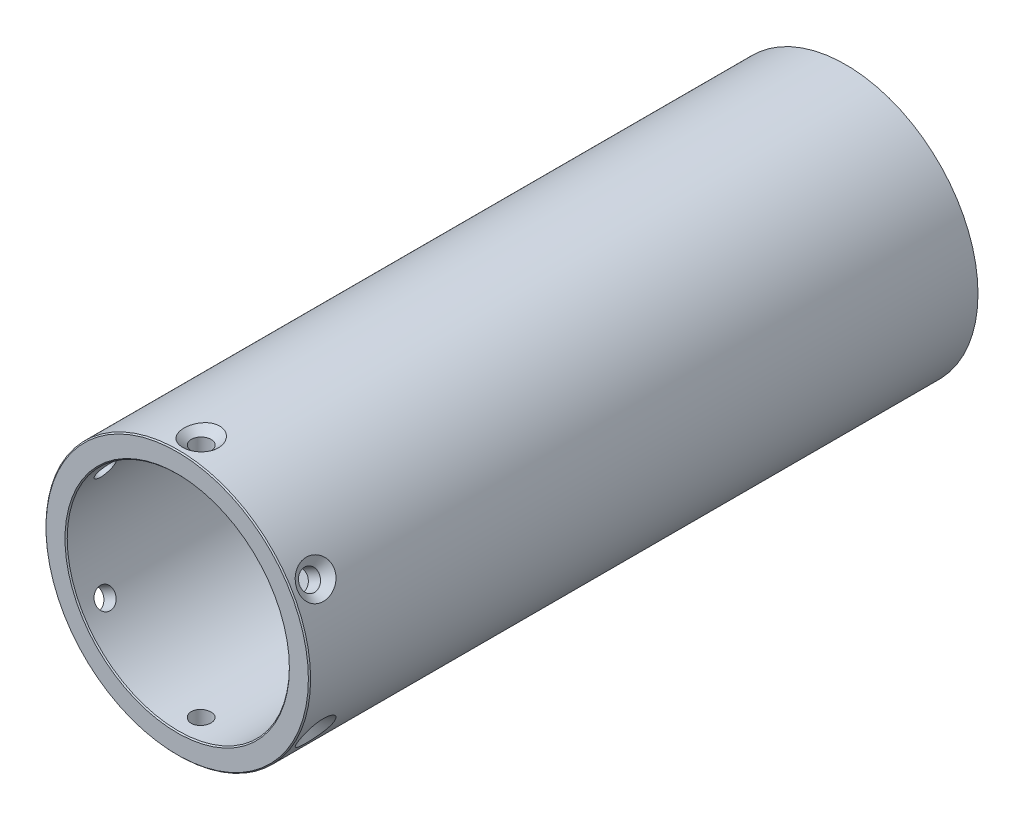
ISO-10303-21;
HEADER;
FILE_DESCRIPTION(('STEP AP214'),'2;1');
FILE_NAME('part.step','',(''),(''),'','','');
FILE_SCHEMA(('AUTOMOTIVE_DESIGN { 1 0 10303 214 1 1 1 1 }'));
ENDSEC;
DATA;
#1=APPLICATION_CONTEXT('core data for automotive mechanical design processes');
#2=APPLICATION_PROTOCOL_DEFINITION('international standard','automotive_design',2000,#1);
#3=PRODUCT_CONTEXT('',#1,'mechanical');
#4=PRODUCT('Part','Part','',(#3));
#5=PRODUCT_RELATED_PRODUCT_CATEGORY('part','',(#4));
#6=PRODUCT_DEFINITION_FORMATION('','',#4);
#7=PRODUCT_DEFINITION_CONTEXT('part definition',#1,'design');
#8=PRODUCT_DEFINITION('design','',#6,#7);
#9=PRODUCT_DEFINITION_SHAPE('','',#8);
#10=(LENGTH_UNIT() NAMED_UNIT(*) SI_UNIT(.MILLI.,.METRE.));
#11=(NAMED_UNIT(*) PLANE_ANGLE_UNIT() SI_UNIT($,.RADIAN.));
#12=(NAMED_UNIT(*) SI_UNIT($,.STERADIAN.) SOLID_ANGLE_UNIT());
#13=UNCERTAINTY_MEASURE_WITH_UNIT(LENGTH_MEASURE(1.E-05),#10,'distance_accuracy_value','');
#14=(GEOMETRIC_REPRESENTATION_CONTEXT(3) GLOBAL_UNCERTAINTY_ASSIGNED_CONTEXT((#13)) GLOBAL_UNIT_ASSIGNED_CONTEXT((#10,
#11,#12)) REPRESENTATION_CONTEXT('',''));
#15=CARTESIAN_POINT('',(0.,0.,0.));
#16=DIRECTION('',(0.,0.,1.));
#17=DIRECTION('',(1.,0.,0.));
#18=AXIS2_PLACEMENT_3D('',#15,#16,#17);
#19=CARTESIAN_POINT('',(0.,0.,76.2));
#20=DIRECTION('',(0.,0.,1.));
#21=DIRECTION('',(1.,0.,0.));
#22=AXIS2_PLACEMENT_3D('',#19,#20,#21);
#23=PLANE('',#22);
#24=CARTESIAN_POINT('',(0.,0.,76.2));
#25=DIRECTION('',(0.,0.,1.));
#26=DIRECTION('',(1.,0.,0.));
#27=AXIS2_PLACEMENT_3D('',#24,#25,#26);
#28=CIRCLE('',#27,29.9085);
#29=CARTESIAN_POINT('',(29.9085,0.,76.2));
#30=VERTEX_POINT('',#29);
#31=EDGE_CURVE('E42',#30,#30,#28,.T.);
#32=ORIENTED_EDGE('',*,*,#31,.T.);
#33=EDGE_LOOP('',(#32));
#34=FACE_BOUND('',#33,.T.);
#35=CARTESIAN_POINT('',(0.,0.,76.2));
#36=DIRECTION('',(0.,0.,1.));
#37=DIRECTION('',(1.,0.,0.));
#38=AXIS2_PLACEMENT_3D('',#35,#36,#37);
#39=CIRCLE('',#38,25.5778);
#40=CARTESIAN_POINT('',(25.5778,0.,76.2));
#41=VERTEX_POINT('',#40);
#42=EDGE_CURVE('E46',#41,#41,#39,.F.);
#43=ORIENTED_EDGE('',*,*,#42,.T.);
#44=EDGE_LOOP('',(#43));
#45=FACE_BOUND('',#44,.T.);
#46=ADVANCED_FACE('F31',(#34,#45),#23,.T.);
#47=CARTESIAN_POINT('',(0.,0.,76.2));
#48=DIRECTION('',(0.,0.,-1.));
#49=DIRECTION('',(-1.,0.,0.));
#50=AXIS2_PLACEMENT_3D('',#47,#48,#49);
#51=CYLINDRICAL_SURFACE('',#50,30.1625);
#52=CARTESIAN_POINT('',(0.,0.,75.946));
#53=DIRECTION('',(0.,0.,1.));
#54=DIRECTION('',(1.,0.,0.));
#55=AXIS2_PLACEMENT_3D('',#52,#53,#54);
#56=CIRCLE('',#55,30.1625);
#57=CARTESIAN_POINT('',(30.1625,0.,75.946));
#58=VERTEX_POINT('',#57);
#59=EDGE_CURVE('E38',#58,#58,#56,.F.);
#60=ORIENTED_EDGE('',*,*,#59,.T.);
#61=EDGE_LOOP('',(#60));
#62=FACE_BOUND('',#61,.T.);
#63=CARTESIAN_POINT('',(-27.2870894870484,12.8526710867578,67.5012634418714));
#64=CARTESIAN_POINT('',(-27.2250666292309,12.9843482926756,67.3700718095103));
#65=CARTESIAN_POINT('',(-27.1580130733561,13.1242300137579,67.2494816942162));
#66=CARTESIAN_POINT('',(-27.0143017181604,13.4175471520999,67.0328566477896));
#67=CARTESIAN_POINT('',(-26.937641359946,13.5709861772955,66.9368282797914));
#68=CARTESIAN_POINT('',(-26.7659670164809,13.9067956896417,66.7626803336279));
#69=CARTESIAN_POINT('',(-26.6698545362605,14.0904361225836,66.6880520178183));
#70=CARTESIAN_POINT('',(-26.4688956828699,14.4644032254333,66.5769579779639));
#71=CARTESIAN_POINT('',(-26.3640499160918,14.6547294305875,66.5404896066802));
#72=CARTESIAN_POINT('',(-26.1552525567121,15.0240283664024,66.5084935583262));
#73=CARTESIAN_POINT('',(-26.051633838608,15.2029881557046,66.51061253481));
#74=CARTESIAN_POINT('',(-25.8425025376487,15.5558192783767,66.5499645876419));
#75=CARTESIAN_POINT('',(-25.7369903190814,15.7296915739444,66.5871909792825));
#76=CARTESIAN_POINT('',(-25.529185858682,16.0647232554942,66.6942114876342));
#77=CARTESIAN_POINT('',(-25.4268693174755,16.226047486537,66.7634462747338));
#78=CARTESIAN_POINT('',(-25.2267534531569,16.5354562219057,66.9315856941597));
#79=CARTESIAN_POINT('',(-25.1289548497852,16.683538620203,67.0304950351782));
#80=CARTESIAN_POINT('',(-24.936788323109,16.9695004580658,67.2593041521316));
#81=CARTESIAN_POINT('',(-24.8427382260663,17.1066877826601,67.3903334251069));
#82=CARTESIAN_POINT('',(-24.6654839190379,17.3612910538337,67.6766545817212));
#83=CARTESIAN_POINT('',(-24.5822829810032,17.4787010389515,67.8319537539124));
#84=CARTESIAN_POINT('',(-24.4235148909,17.6999501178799,68.1744670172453));
#85=CARTESIAN_POINT('',(-24.3489425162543,17.802181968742,68.3631805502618));
#86=CARTESIAN_POINT('',(-24.2173121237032,17.9808382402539,68.7581097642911));
#87=CARTESIAN_POINT('',(-24.1602595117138,18.0572546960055,68.9643308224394));
#88=CARTESIAN_POINT('',(-24.0622709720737,18.1876513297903,69.4030123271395));
#89=CARTESIAN_POINT('',(-24.0226464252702,18.23981900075,69.6363063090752));
#90=CARTESIAN_POINT('',(-23.9666212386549,18.3133725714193,70.1104207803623));
#91=CARTESIAN_POINT('',(-23.9502255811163,18.3347518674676,70.3512428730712));
#92=CARTESIAN_POINT('',(-23.9410596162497,18.3467206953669,70.842924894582));
#93=CARTESIAN_POINT('',(-23.9491726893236,18.3361589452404,71.0938306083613));
#94=CARTESIAN_POINT('',(-23.9906729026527,18.2818261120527,71.5899230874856));
#95=CARTESIAN_POINT('',(-24.0240627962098,18.2380514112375,71.8351092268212));
#96=CARTESIAN_POINT('',(-24.1150866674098,18.1175246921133,72.3136360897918));
#97=CARTESIAN_POINT('',(-24.1728150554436,18.0406442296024,72.5469266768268));
#98=CARTESIAN_POINT('',(-24.3104058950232,17.8547999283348,72.9934028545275));
#99=CARTESIAN_POINT('',(-24.3902670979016,17.7458378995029,73.2065895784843));
#100=CARTESIAN_POINT('',(-24.5663796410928,17.5011816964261,73.5994684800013));
#101=CARTESIAN_POINT('',(-24.6620630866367,17.3663943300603,73.779977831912));
#102=CARTESIAN_POINT('',(-24.8677812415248,17.0705066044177,74.1083588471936));
#103=CARTESIAN_POINT('',(-24.9778096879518,16.9094177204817,74.2562446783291));
#104=CARTESIAN_POINT('',(-25.2001256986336,16.5761108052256,74.5043558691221));
#105=CARTESIAN_POINT('',(-25.3117780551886,16.4053421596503,74.6070940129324));
#106=CARTESIAN_POINT('',(-25.5394966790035,16.048524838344,74.7738221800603));
#107=CARTESIAN_POINT('',(-25.655560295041,15.8624852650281,74.8378350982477));
#108=CARTESIAN_POINT('',(-25.8787415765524,15.4954744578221,74.9206570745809));
#109=CARTESIAN_POINT('',(-25.9858669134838,15.3151974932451,74.9425393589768));
#110=CARTESIAN_POINT('',(-26.196580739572,14.951909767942,74.949551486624));
#111=CARTESIAN_POINT('',(-26.3001701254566,14.7688997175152,74.9346907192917));
#112=CARTESIAN_POINT('',(-26.497061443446,14.4125673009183,74.8701490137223));
#113=CARTESIAN_POINT('',(-26.590602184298,14.2391370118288,74.8217765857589));
#114=CARTESIAN_POINT('',(-26.7695106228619,13.8998748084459,74.6936068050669));
#115=CARTESIAN_POINT('',(-26.8548777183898,13.7340434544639,74.6138071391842));
#116=CARTESIAN_POINT('',(-27.0179981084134,13.4103647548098,74.423411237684));
#117=CARTESIAN_POINT('',(-27.0955098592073,13.2528177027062,74.312099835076));
#118=CARTESIAN_POINT('',(-27.2395570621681,12.9541685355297,74.063413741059));
#119=CARTESIAN_POINT('',(-27.3060895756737,12.8130708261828,73.9260320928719));
#120=CARTESIAN_POINT('',(-27.4318616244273,12.541660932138,73.6193441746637));
#121=CARTESIAN_POINT('',(-27.4903137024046,12.4127050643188,73.44851552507));
#122=CARTESIAN_POINT('',(-27.5941884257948,12.1800428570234,73.0868862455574));
#123=CARTESIAN_POINT('',(-27.6396068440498,12.0763447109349,72.8960791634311));
#124=CARTESIAN_POINT('',(-27.7203267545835,11.8899531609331,72.4852289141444));
#125=CARTESIAN_POINT('',(-27.7546691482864,11.8092993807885,72.2640704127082));
#126=CARTESIAN_POINT('',(-27.8087325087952,11.6814226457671,71.8105872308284));
#127=CARTESIAN_POINT('',(-27.8284501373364,11.6342073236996,71.5782600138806));
#128=CARTESIAN_POINT('',(-27.8540108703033,11.5728857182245,71.0973521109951));
#129=CARTESIAN_POINT('',(-27.8591577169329,11.5604412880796,70.8485209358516));
#130=CARTESIAN_POINT('',(-27.8536417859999,11.5737238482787,70.3519997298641));
#131=CARTESIAN_POINT('',(-27.8429748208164,11.5994609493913,70.104310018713));
#132=CARTESIAN_POINT('',(-27.8054517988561,11.6891250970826,69.613445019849));
#133=CARTESIAN_POINT('',(-27.7783632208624,11.7536005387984,69.370387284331));
#134=CARTESIAN_POINT('',(-27.7075651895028,11.9195355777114,68.8998563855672));
#135=CARTESIAN_POINT('',(-27.6638648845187,12.020974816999,68.6723747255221));
#136=CARTESIAN_POINT('',(-27.5689824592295,12.2367820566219,68.2790201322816));
#137=CARTESIAN_POINT('',(-27.520539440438,12.3455863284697,68.1094076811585));
#138=CARTESIAN_POINT('',(-27.4122867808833,12.5841194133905,67.7896976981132));
#139=CARTESIAN_POINT('',(-27.3524844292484,12.7138348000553,67.6395877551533));
#140=CARTESIAN_POINT('',(-27.2870894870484,12.8526710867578,67.5012634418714));
#141=B_SPLINE_CURVE_WITH_KNOTS('',3,(#63,#64,#65,#66,#67,#68,#69,#70,#71,#72,#73,#74,#75,#76,
#77,#78,#79,#80,#81,#82,#83,#84,#85,#86,#87,#88,#89,#90,#91,#92,#93,#94,#95,#96,#97,#98,#99,
#100,#101,#102,#103,#104,#105,#106,#107,#108,#109,#110,#111,#112,#113,#114,#115,#116,#117,#118,
#119,#120,#121,#122,#123,#124,#125,#126,#127,#128,#129,#130,#131,#132,#133,#134,#135,#136,#137,
#138,#139,#140),.UNSPECIFIED.,.T.,.F.,(4,2,2,2,2,2,2,2,2,2,2,2,2,2,2,2,2,2,2,2,2,2,2,2,2,2,2,2,
2,2,2,2,2,2,2,2,2,2,4),(0.,0.587296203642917,1.17474917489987,1.83211277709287,2.48943077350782,
3.10680251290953,3.72405672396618,4.33091031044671,4.93786024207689,5.57036564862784,
6.20306137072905,6.8817559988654,7.56065983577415,8.28434716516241,9.0081896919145,
9.75842949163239,10.5087510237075,11.2620102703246,12.0152270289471,12.7456939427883,
13.4758430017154,14.1575062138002,14.8387660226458,15.4681065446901,16.0972862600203,
16.7031894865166,17.3091373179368,17.9301237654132,18.5512761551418,19.2140520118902,
19.8770425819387,20.587578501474,21.2982765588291,22.0424044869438,22.786729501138,
23.5418482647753,24.2965517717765,24.9161746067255,25.5354011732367),.UNSPECIFIED.);
#142=CARTESIAN_POINT('',(-27.2870894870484,12.8526710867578,67.5012634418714));
#143=VERTEX_POINT('',#142);
#144=EDGE_CURVE('E51',#143,#143,#141,.T.);
#145=ORIENTED_EDGE('',*,*,#144,.T.);
#146=EDGE_LOOP('',(#145));
#147=FACE_BOUND('',#146,.T.);
#148=CARTESIAN_POINT('',(-25.7964790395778,-15.6306797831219,66.5704942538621));
#149=CARTESIAN_POINT('',(-25.8996598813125,-15.460388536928,66.5348744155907));
#150=CARTESIAN_POINT('',(-26.0027348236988,-15.2864353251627,66.5158669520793));
#151=CARTESIAN_POINT('',(-26.2055393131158,-14.9361015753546,66.5119669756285));
#152=CARTESIAN_POINT('',(-26.3052665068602,-14.7597194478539,66.5270979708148));
#153=CARTESIAN_POINT('',(-26.4984727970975,-14.4099692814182,66.590800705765));
#154=CARTESIAN_POINT('',(-26.5919611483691,-14.2365970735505,66.6393216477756));
#155=CARTESIAN_POINT('',(-26.7707473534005,-13.8974919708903,66.7677597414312));
#156=CARTESIAN_POINT('',(-26.8560451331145,-13.7317591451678,66.8476771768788));
#157=CARTESIAN_POINT('',(-27.0190621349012,-13.4082199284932,67.0383186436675));
#158=CARTESIAN_POINT('',(-27.0965356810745,-13.2507192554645,67.1497694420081));
#159=CARTESIAN_POINT('',(-27.2405008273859,-12.9521830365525,67.3987228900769));
#160=CARTESIAN_POINT('',(-27.3069894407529,-12.8111519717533,67.5362326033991));
#161=CARTESIAN_POINT('',(-27.4326698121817,-12.5398919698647,67.8431775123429));
#162=CARTESIAN_POINT('',(-27.4910733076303,-12.4110215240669,68.0141351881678));
#163=CARTESIAN_POINT('',(-27.5948467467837,-12.1785501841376,68.3760063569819));
#164=CARTESIAN_POINT('',(-27.6402124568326,-12.0749574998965,68.5669263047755));
#165=CARTESIAN_POINT('',(-27.7208179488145,-11.8888066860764,68.9779833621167));
#166=CARTESIAN_POINT('',(-27.7550989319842,-11.8082883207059,69.1992337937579));
#167=CARTESIAN_POINT('',(-27.8090372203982,-11.6806963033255,69.6528807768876));
#168=CARTESIAN_POINT('',(-27.8286908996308,-11.6336309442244,69.8852800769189));
#169=CARTESIAN_POINT('',(-27.8541163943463,-11.5726312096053,70.3663046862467));
#170=CARTESIAN_POINT('',(-27.8591920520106,-11.5603586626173,70.6151791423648));
#171=CARTESIAN_POINT('',(-27.853530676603,-11.5739913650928,71.1117218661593));
#172=CARTESIAN_POINT('',(-27.8427913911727,-11.5999020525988,71.3593899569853));
#173=CARTESIAN_POINT('',(-27.8051240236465,-11.6899054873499,71.850116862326));
#174=CARTESIAN_POINT('',(-27.7779681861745,-11.7545352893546,72.0930602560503));
#175=CARTESIAN_POINT('',(-27.7070360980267,-11.9207667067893,72.5634340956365));
#176=CARTESIAN_POINT('',(-27.6632595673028,-12.0223689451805,72.7908642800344));
#177=CARTESIAN_POINT('',(-27.5598119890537,-12.2576228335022,73.2188730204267));
#178=CARTESIAN_POINT('',(-27.5004510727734,-12.3906445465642,73.4198716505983));
#179=CARTESIAN_POINT('',(-27.3654419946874,-12.6860259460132,73.7928102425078));
#180=CARTESIAN_POINT('',(-27.2897987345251,-12.8483768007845,73.9647589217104));
#181=CARTESIAN_POINT('',(-27.1273833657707,-13.1876759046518,74.2640046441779));
#182=CARTESIAN_POINT('',(-27.0414664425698,-13.3633063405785,74.3932561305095));
#183=CARTESIAN_POINT('',(-26.856740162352,-13.7307695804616,74.6140135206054));
#184=CARTESIAN_POINT('',(-26.7579386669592,-13.922592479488,74.7055423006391));
#185=CARTESIAN_POINT('',(-26.5578412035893,-14.3003333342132,74.8408711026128));
#186=CARTESIAN_POINT('',(-26.4573444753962,-14.4855400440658,74.8878437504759));
#187=CARTESIAN_POINT('',(-26.2499425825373,-14.8580711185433,74.9437453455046));
#188=CARTESIAN_POINT('',(-26.1430399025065,-15.045394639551,74.952688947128));
#189=CARTESIAN_POINT('',(-25.9320810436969,-15.4060015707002,74.9326960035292));
#190=CARTESIAN_POINT('',(-25.8281850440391,-15.5794953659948,74.9057880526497));
#191=CARTESIAN_POINT('',(-25.620833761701,-15.9181885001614,74.8187724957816));
#192=CARTESIAN_POINT('',(-25.5173784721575,-16.0833879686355,74.7586654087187));
#193=CARTESIAN_POINT('',(-25.3135784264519,-16.4022926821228,74.607261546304));
#194=CARTESIAN_POINT('',(-25.2132533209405,-16.5559315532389,74.5157992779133));
#195=CARTESIAN_POINT('',(-25.0193260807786,-16.8475651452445,74.3050907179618));
#196=CARTESIAN_POINT('',(-24.9257254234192,-16.9855564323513,74.185838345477));
#197=CARTESIAN_POINT('',(-24.7428435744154,-17.2509586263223,73.915814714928));
#198=CARTESIAN_POINT('',(-24.6541166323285,-17.3773112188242,73.76362964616));
#199=CARTESIAN_POINT('',(-24.4898532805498,-17.6080549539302,73.4371266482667));
#200=CARTESIAN_POINT('',(-24.4143210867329,-17.7124390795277,73.2628016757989));
#201=CARTESIAN_POINT('',(-24.2735774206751,-17.9048915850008,72.883097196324));
#202=CARTESIAN_POINT('',(-24.2095482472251,-17.9911736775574,72.6763730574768));
#203=CARTESIAN_POINT('',(-24.1012659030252,-18.1359748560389,72.2485267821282));
#204=CARTESIAN_POINT('',(-24.0570183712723,-18.1944860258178,72.0274005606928));
#205=CARTESIAN_POINT('',(-23.9877844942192,-18.285680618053,71.563546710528));
#206=CARTESIAN_POINT('',(-23.9640377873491,-18.3167044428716,71.3203059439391));
#207=CARTESIAN_POINT('',(-23.9410431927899,-18.3467493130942,70.8306966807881));
#208=CARTESIAN_POINT('',(-23.9417995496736,-18.3457648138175,70.5843276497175));
#209=CARTESIAN_POINT('',(-23.9681166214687,-18.3113703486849,70.0890227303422));
#210=CARTESIAN_POINT('',(-23.9942907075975,-18.2771585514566,69.8401742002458));
#211=CARTESIAN_POINT('',(-24.0714000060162,-18.1754819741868,69.3533038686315));
#212=CARTESIAN_POINT('',(-24.1223362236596,-18.1080158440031,69.1152825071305));
#213=CARTESIAN_POINT('',(-24.2466129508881,-17.9412612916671,68.6590388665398));
#214=CARTESIAN_POINT('',(-24.319779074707,-17.8422202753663,68.4406790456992));
#215=CARTESIAN_POINT('',(-24.4859634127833,-17.6134580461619,68.0288598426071));
#216=CARTESIAN_POINT('',(-24.5789827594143,-17.483735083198,67.8354018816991));
#217=CARTESIAN_POINT('',(-24.7768576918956,-17.20209342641,67.4883901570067));
#218=CARTESIAN_POINT('',(-24.881029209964,-17.0513742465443,67.333474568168));
#219=CARTESIAN_POINT('',(-25.1001627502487,-16.7271111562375,67.0596094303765));
#220=CARTESIAN_POINT('',(-25.215105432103,-16.5536079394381,66.9405969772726));
#221=CARTESIAN_POINT('',(-25.408667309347,-16.2540928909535,66.7792721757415));
#222=CARTESIAN_POINT('',(-25.4855222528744,-16.133376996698,66.7247611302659));
#223=CARTESIAN_POINT('',(-25.6404314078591,-15.8860309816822,66.6338356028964));
#224=CARTESIAN_POINT('',(-25.7184854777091,-15.7594015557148,66.597419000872));
#225=CARTESIAN_POINT('',(-25.7964790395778,-15.6306797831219,66.5704942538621));
#226=B_SPLINE_CURVE_WITH_KNOTS('',3,(#148,#149,#150,#151,#152,#153,#154,#155,#156,#157,#158,
#159,#160,#161,#162,#163,#164,#165,#166,#167,#168,#169,#170,#171,#172,#173,#174,#175,#176,#177,
#178,#179,#180,#181,#182,#183,#184,#185,#186,#187,#188,#189,#190,#191,#192,#193,#194,#195,#196,
#197,#198,#199,#200,#201,#202,#203,#204,#205,#206,#207,#208,#209,#210,#211,#212,#213,#214,#215,
#216,#217,#218,#219,#220,#221,#222,#223,#224,#225),.UNSPECIFIED.,.T.,.F.,(4,2,2,2,2,2,2,2,2,2,2,
2,2,2,2,2,2,2,2,2,2,2,2,2,2,2,2,2,2,2,2,2,2,2,2,2,2,2,4),(0.,0.606265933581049,1.21294947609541,
1.81871207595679,2.42448015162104,3.04554054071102,3.66676951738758,4.3296555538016,
4.99275660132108,5.7033840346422,6.41418756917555,7.15841221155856,7.90274285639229,
8.65764486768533,9.4125595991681,10.1534609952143,10.8941396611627,11.5935388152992,
12.2925132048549,12.9368286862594,13.5808958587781,14.1900238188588,14.7991422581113,
15.4115264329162,16.0240447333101,16.671636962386,17.3194357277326,18.0153206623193,
18.7114038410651,19.4471062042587,20.1829360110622,20.9369754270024,21.6910454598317,
22.4393464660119,23.1876901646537,23.9037375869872,24.6185230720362,25.076848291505,
25.5351197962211),.UNSPECIFIED.);
#227=CARTESIAN_POINT('',(-25.7964790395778,-15.6306797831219,66.5704942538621));
#228=VERTEX_POINT('',#227);
#229=EDGE_CURVE('E88',#228,#228,#226,.T.);
#230=ORIENTED_EDGE('',*,*,#229,.T.);
#231=EDGE_LOOP('',(#230));
#232=FACE_BOUND('',#231,.T.);
#233=CARTESIAN_POINT('',(-2.85279454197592,-30.0272870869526,67.8480172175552));
#234=CARTESIAN_POINT('',(-3.00923217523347,-30.0124250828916,68.0277998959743));
#235=CARTESIAN_POINT('',(-3.15020192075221,-29.997801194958,68.2213353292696));
#236=CARTESIAN_POINT('',(-3.39811777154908,-29.970733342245,68.6294898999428));
#237=CARTESIAN_POINT('',(-3.50500220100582,-29.9582933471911,68.8441463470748));
#238=CARTESIAN_POINT('',(-3.68282510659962,-29.9369549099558,69.2887376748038));
#239=CARTESIAN_POINT('',(-3.75366034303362,-29.9280666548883,69.5187143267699));
#240=CARTESIAN_POINT('',(-3.85765261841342,-29.914840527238,69.9870459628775));
#241=CARTESIAN_POINT('',(-3.89082106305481,-29.9105012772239,70.2253983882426));
#242=CARTESIAN_POINT('',(-3.91954890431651,-29.9067516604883,70.7143661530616));
#243=CARTESIAN_POINT('',(-3.91348926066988,-29.9075534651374,70.9650796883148));
#244=CARTESIAN_POINT('',(-3.86002927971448,-29.9144996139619,71.4620414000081));
#245=CARTESIAN_POINT('',(-3.81261965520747,-29.9206451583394,71.7082885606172));
#246=CARTESIAN_POINT('',(-3.67687391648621,-29.9376300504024,72.190862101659));
#247=CARTESIAN_POINT('',(-3.58826982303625,-29.9485001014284,72.4271123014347));
#248=CARTESIAN_POINT('',(-3.37175104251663,-29.9736471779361,72.8807243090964));
#249=CARTESIAN_POINT('',(-3.24383821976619,-29.9879240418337,73.0980870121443));
#250=CARTESIAN_POINT('',(-2.95536845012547,-30.0177047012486,73.5010483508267));
#251=CARTESIAN_POINT('',(-2.79578634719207,-30.0331649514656,73.6873462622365));
#252=CARTESIAN_POINT('',(-2.44563018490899,-30.0637000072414,74.0282052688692));
#253=CARTESIAN_POINT('',(-2.2550685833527,-30.0787749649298,74.1827790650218));
#254=CARTESIAN_POINT('',(-1.86115608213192,-30.1056291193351,74.4448924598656));
#255=CARTESIAN_POINT('',(-1.6593950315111,-30.1175571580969,74.5548023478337));
#256=CARTESIAN_POINT('',(-1.23906902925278,-30.1377706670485,74.7360500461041));
#257=CARTESIAN_POINT('',(-1.02051425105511,-30.1460583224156,74.8074110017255));
#258=CARTESIAN_POINT('',(-0.591096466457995,-30.1574127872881,74.9041367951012));
#259=CARTESIAN_POINT('',(-0.380944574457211,-30.1608336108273,74.932630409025));
#260=CARTESIAN_POINT('',(0.0411081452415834,-30.1632091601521,74.9524787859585));
#261=CARTESIAN_POINT('',(0.253008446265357,-30.1621651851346,74.9438443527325));
#262=CARTESIAN_POINT('',(0.663161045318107,-30.155877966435,74.8910055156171));
#263=CARTESIAN_POINT('',(0.861613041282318,-30.1508126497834,74.8483078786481));
#264=CARTESIAN_POINT('',(1.24869991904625,-30.1372641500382,74.73101356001));
#265=CARTESIAN_POINT('',(1.43733429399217,-30.1287807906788,74.6564152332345));
#266=CARTESIAN_POINT('',(1.80371923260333,-30.109091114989,74.4763851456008));
#267=CARTESIAN_POINT('',(1.9811808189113,-30.0978342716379,74.3703728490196));
#268=CARTESIAN_POINT('',(2.3171269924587,-30.0738382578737,74.1318194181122));
#269=CARTESIAN_POINT('',(2.47560672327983,-30.0610987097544,73.9992715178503));
#270=CARTESIAN_POINT('',(2.78011659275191,-30.0345175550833,73.7023327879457));
#271=CARTESIAN_POINT('',(2.92467482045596,-30.0206580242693,73.5364352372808));
#272=CARTESIAN_POINT('',(3.18614823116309,-29.9940357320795,73.1840630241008));
#273=CARTESIAN_POINT('',(3.30305448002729,-29.9812733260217,72.9975817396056));
#274=CARTESIAN_POINT('',(3.51471721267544,-29.9572257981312,72.5947881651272));
#275=CARTESIAN_POINT('',(3.60724479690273,-29.9461155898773,72.3772927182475));
#276=CARTESIAN_POINT('',(3.75663619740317,-29.9277424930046,71.9302265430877));
#277=CARTESIAN_POINT('',(3.8134907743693,-29.9204806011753,71.7006527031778));
#278=CARTESIAN_POINT('',(3.89249481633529,-29.9103092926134,71.2237132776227));
#279=CARTESIAN_POINT('',(3.9127738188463,-29.9076347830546,70.9760311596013));
#280=CARTESIAN_POINT('',(3.91258177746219,-29.9076595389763,70.4806632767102));
#281=CARTESIAN_POINT('',(3.89210457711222,-29.9103596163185,70.2329775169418));
#282=CARTESIAN_POINT('',(3.81006048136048,-29.9209221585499,69.7402353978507));
#283=CARTESIAN_POINT('',(3.74779862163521,-29.9288718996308,69.4952959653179));
#284=CARTESIAN_POINT('',(3.58265120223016,-29.9490884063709,69.0196498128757));
#285=CARTESIAN_POINT('',(3.47976434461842,-29.9613553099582,68.7889435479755));
#286=CARTESIAN_POINT('',(3.23731825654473,-29.9885106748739,68.3524756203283));
#287=CARTESIAN_POINT('',(3.09835155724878,-30.0033556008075,68.1463830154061));
#288=CARTESIAN_POINT('',(2.78599977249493,-30.0339664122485,67.7621760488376));
#289=CARTESIAN_POINT('',(2.61262371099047,-30.0497320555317,67.5840543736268));
#290=CARTESIAN_POINT('',(2.24570181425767,-30.0793158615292,67.2713303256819));
#291=CARTESIAN_POINT('',(2.05369286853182,-30.0931928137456,67.1349340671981));
#292=CARTESIAN_POINT('',(1.64784577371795,-30.1181369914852,66.8994430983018));
#293=CARTESIAN_POINT('',(1.43402071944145,-30.129205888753,66.8003261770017));
#294=CARTESIAN_POINT('',(1.00857583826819,-30.1463251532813,66.6502727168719));
#295=CARTESIAN_POINT('',(0.798077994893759,-30.152698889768,66.5961884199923));
#296=CARTESIAN_POINT('',(0.370760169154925,-30.1609765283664,66.5263376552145));
#297=CARTESIAN_POINT('',(0.153943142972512,-30.1628824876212,66.5105535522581));
#298=CARTESIAN_POINT('',(-0.266288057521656,-30.162014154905,66.517810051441));
#299=CARTESIAN_POINT('',(-0.469744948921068,-30.1595068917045,66.5386354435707));
#300=CARTESIAN_POINT('',(-0.870258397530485,-30.1506084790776,66.6139798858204));
#301=CARTESIAN_POINT('',(-1.06731372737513,-30.1442165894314,66.6685053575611));
#302=CARTESIAN_POINT('',(-1.44969447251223,-30.12825054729,66.8090136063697));
#303=CARTESIAN_POINT('',(-1.63501768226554,-30.1186757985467,66.8950022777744));
#304=CARTESIAN_POINT('',(-1.98938342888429,-30.0973465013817,67.0952061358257));
#305=CARTESIAN_POINT('',(-2.15844001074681,-30.0855938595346,67.2093966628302));
#306=CARTESIAN_POINT('',(-2.41448110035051,-30.0658638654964,67.4126740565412));
#307=CARTESIAN_POINT('',(-2.50769466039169,-30.0582088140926,67.4940989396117));
#308=CARTESIAN_POINT('',(-2.6862586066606,-30.0427768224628,67.6651206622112));
#309=CARTESIAN_POINT('',(-2.77160948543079,-30.0349998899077,67.7547169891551));
#310=CARTESIAN_POINT('',(-2.85279454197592,-30.0272870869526,67.8480172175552));
#311=B_SPLINE_CURVE_WITH_KNOTS('',3,(#233,#234,#235,#236,#237,#238,#239,#240,#241,#242,#243,
#244,#245,#246,#247,#248,#249,#250,#251,#252,#253,#254,#255,#256,#257,#258,#259,#260,#261,#262,
#263,#264,#265,#266,#267,#268,#269,#270,#271,#272,#273,#274,#275,#276,#277,#278,#279,#280,#281,
#282,#283,#284,#285,#286,#287,#288,#289,#290,#291,#292,#293,#294,#295,#296,#297,#298,#299,#300,
#301,#302,#303,#304,#305,#306,#307,#308,#309,#310),.UNSPECIFIED.,.T.,.F.,(4,2,2,2,2,2,2,2,2,2,2,
2,2,2,2,2,2,2,2,2,2,2,2,2,2,2,2,2,2,2,2,2,2,2,2,2,2,2,4),(0.,0.715875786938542,1.43303966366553,
2.15224599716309,2.87123449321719,3.62008132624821,4.36909639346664,5.12305365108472,
5.87697515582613,6.61053688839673,7.34380435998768,8.03032450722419,8.71643199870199,
9.34950968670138,9.98240317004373,10.5887570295,11.1951421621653,11.8135180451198,
12.43205180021,13.0906611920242,13.7494830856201,14.4562135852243,15.1631270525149,
15.9052648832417,16.6475148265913,17.4024263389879,18.1573619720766,18.9006076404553,
19.6436586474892,20.3476973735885,21.05131596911,21.7002088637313,22.3488029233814,
22.9594896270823,23.5702927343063,24.1812103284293,24.7915956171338,25.1631306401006,
25.5346423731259),.UNSPECIFIED.);
#312=CARTESIAN_POINT('',(-2.85279454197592,-30.0272870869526,67.8480172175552));
#313=VERTEX_POINT('',#312);
#314=EDGE_CURVE('E94',#313,#313,#311,.T.);
#315=ORIENTED_EDGE('',*,*,#314,.T.);
#316=EDGE_LOOP('',(#315));
#317=FACE_BOUND('',#316,.T.);
#318=CARTESIAN_POINT('',(24.7223986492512,-17.279450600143,67.5856252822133));
#319=CARTESIAN_POINT('',(24.6417073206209,-17.3948994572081,67.7206095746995));
#320=CARTESIAN_POINT('',(24.565760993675,-17.5018361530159,67.8657668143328));
#321=CARTESIAN_POINT('',(24.4251870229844,-17.6974910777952,68.1729768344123));
#322=CARTESIAN_POINT('',(24.3605700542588,-17.786192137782,68.3350453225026));
#323=CARTESIAN_POINT('',(24.2324546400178,-17.960471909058,68.7066998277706));
#324=CARTESIAN_POINT('',(24.1718096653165,-18.0418135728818,68.9192773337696));
#325=CARTESIAN_POINT('',(24.0710976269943,-18.1759655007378,69.3579014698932));
#326=CARTESIAN_POINT('',(24.0310401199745,-18.2287625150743,69.5839543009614));
#327=CARTESIAN_POINT('',(23.9713528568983,-18.3071910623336,70.0551551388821));
#328=CARTESIAN_POINT('',(23.9528399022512,-18.331338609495,70.3006934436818));
#329=CARTESIAN_POINT('',(23.9405935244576,-18.347329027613,70.7934348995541));
#330=CARTESIAN_POINT('',(23.9468626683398,-18.3391685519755,71.0406382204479));
#331=CARTESIAN_POINT('',(23.9843594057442,-18.2901035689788,71.5352153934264));
#332=CARTESIAN_POINT('',(24.0161138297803,-18.2485078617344,71.7824815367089));
#333=CARTESIAN_POINT('',(24.1040874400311,-18.1321443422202,72.2645973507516));
#334=CARTESIAN_POINT('',(24.1603082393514,-18.0573743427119,72.4994462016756));
#335=CARTESIAN_POINT('',(24.294373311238,-17.8765854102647,72.946928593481));
#336=CARTESIAN_POINT('',(24.3719675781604,-17.7709269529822,73.1597820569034));
#337=CARTESIAN_POINT('',(24.5461610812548,-17.5295307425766,73.5590907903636));
#338=CARTESIAN_POINT('',(24.6427562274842,-17.393799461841,73.7455517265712));
#339=CARTESIAN_POINT('',(24.8461769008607,-17.1018699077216,74.0767492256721));
#340=CARTESIAN_POINT('',(24.9522923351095,-16.9469607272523,74.2230546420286));
#341=CARTESIAN_POINT('',(25.1742730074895,-16.6154151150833,74.4791110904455));
#342=CARTESIAN_POINT('',(25.2901325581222,-16.4387913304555,74.5888832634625));
#343=CARTESIAN_POINT('',(25.5178177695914,-16.0828644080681,74.7598238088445));
#344=CARTESIAN_POINT('',(25.6292729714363,-15.9048020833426,74.8240703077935));
#345=CARTESIAN_POINT('',(25.852466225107,-15.5393731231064,74.9139450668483));
#346=CARTESIAN_POINT('',(25.9642041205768,-15.3520108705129,74.9395913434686));
#347=CARTESIAN_POINT('',(26.1770307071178,-14.9860418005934,74.9506746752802));
#348=CARTESIAN_POINT('',(26.2783447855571,-14.8076357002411,74.9385645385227));
#349=CARTESIAN_POINT('',(26.4749440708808,-14.4531937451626,74.8799697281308));
#350=CARTESIAN_POINT('',(26.5702297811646,-14.2771576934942,74.8334879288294));
#351=CARTESIAN_POINT('',(26.7517836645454,-13.9339838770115,74.7086321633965));
#352=CARTESIAN_POINT('',(26.8381193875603,-13.7667849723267,74.6305228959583));
#353=CARTESIAN_POINT('',(27.0011784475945,-13.4441619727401,74.4453854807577));
#354=CARTESIAN_POINT('',(27.07790006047,-13.2887399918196,74.3383521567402));
#355=CARTESIAN_POINT('',(27.224324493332,-12.9862310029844,74.0931021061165));
#356=CARTESIAN_POINT('',(27.2935044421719,-12.8399170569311,73.9536218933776));
#357=CARTESIAN_POINT('',(27.41986988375,-12.5678041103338,73.6512182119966));
#358=CARTESIAN_POINT('',(27.4770516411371,-12.442011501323,73.4882874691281));
#359=CARTESIAN_POINT('',(27.5831054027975,-12.2051957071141,73.1307266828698));
#360=CARTESIAN_POINT('',(27.6310513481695,-12.0959503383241,72.934644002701));
#361=CARTESIAN_POINT('',(27.7131207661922,-11.9067211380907,72.5261539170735));
#362=CARTESIAN_POINT('',(27.7472400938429,-11.826746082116,72.3137416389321));
#363=CARTESIAN_POINT('',(27.8035578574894,-11.6937661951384,71.864350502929));
#364=CARTESIAN_POINT('',(27.8248752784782,-11.6427655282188,71.6266663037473));
#365=CARTESIAN_POINT('',(27.852292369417,-11.577024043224,71.1454676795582));
#366=CARTESIAN_POINT('',(27.8583890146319,-11.5622904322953,70.9019521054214));
#367=CARTESIAN_POINT('',(27.855370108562,-11.5695635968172,70.4077831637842));
#368=CARTESIAN_POINT('',(27.8457646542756,-11.592753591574,70.1571490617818));
#369=CARTESIAN_POINT('',(27.8103070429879,-11.6775559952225,69.66361249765));
#370=CARTESIAN_POINT('',(27.7844533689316,-11.7391719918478,69.4207107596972));
#371=CARTESIAN_POINT('',(27.7162907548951,-11.8992083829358,68.9499112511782));
#372=CARTESIAN_POINT('',(27.6739915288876,-11.9976070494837,68.7220047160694));
#373=CARTESIAN_POINT('',(27.5726800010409,-12.2286371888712,68.2882543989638));
#374=CARTESIAN_POINT('',(27.513669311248,-12.3612653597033,68.0824084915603));
#375=CARTESIAN_POINT('',(27.3812731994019,-12.6517502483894,67.7069133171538));
#376=CARTESIAN_POINT('',(27.30847214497,-12.8085447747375,67.5362388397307));
#377=CARTESIAN_POINT('',(27.1476733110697,-13.1459124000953,67.2288867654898));
#378=CARTESIAN_POINT('',(27.0596829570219,-13.3264738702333,67.0921926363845));
#379=CARTESIAN_POINT('',(26.8764370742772,-13.6920532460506,66.8671823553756));
#380=CARTESIAN_POINT('',(26.7821266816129,-13.8758662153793,66.7761414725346));
#381=CARTESIAN_POINT('',(26.5833829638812,-14.2529091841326,66.6329553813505));
#382=CARTESIAN_POINT('',(26.4789555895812,-14.4461336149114,66.5807874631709));
#383=CARTESIAN_POINT('',(26.2708856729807,-14.8209149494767,66.5202378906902));
#384=CARTESIAN_POINT('',(26.1677515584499,-15.0022833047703,66.5089148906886));
#385=CARTESIAN_POINT('',(25.9583103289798,-15.3618286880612,66.5223443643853));
#386=CARTESIAN_POINT('',(25.8520034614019,-15.5400059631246,66.5470940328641));
#387=CARTESIAN_POINT('',(25.642655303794,-15.8830074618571,66.630330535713));
#388=CARTESIAN_POINT('',(25.539606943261,-16.0480671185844,66.687840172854));
#389=CARTESIAN_POINT('',(25.3369251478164,-16.3661906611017,66.8335221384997));
#390=CARTESIAN_POINT('',(25.2372901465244,-16.5192600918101,66.9216801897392));
#391=CARTESIAN_POINT('',(25.0665285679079,-16.7768808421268,67.1020420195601));
#392=CARTESIAN_POINT('',(24.9940992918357,-16.8845147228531,67.1886942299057));
#393=CARTESIAN_POINT('',(24.8542393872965,-17.0897219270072,67.376614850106));
#394=CARTESIAN_POINT('',(24.7868073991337,-17.1872979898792,67.477879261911));
#395=CARTESIAN_POINT('',(24.7223986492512,-17.279450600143,67.5856252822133));
#396=B_SPLINE_CURVE_WITH_KNOTS('',3,(#318,#319,#320,#321,#322,#323,#324,#325,#326,#327,#328,
#329,#330,#331,#332,#333,#334,#335,#336,#337,#338,#339,#340,#341,#342,#343,#344,#345,#346,#347,
#348,#349,#350,#351,#352,#353,#354,#355,#356,#357,#358,#359,#360,#361,#362,#363,#364,#365,#366,
#367,#368,#369,#370,#371,#372,#373,#374,#375,#376,#377,#378,#379,#380,#381,#382,#383,#384,#385,
#386,#387,#388,#389,#390,#391,#392,#393,#394,#395),.UNSPECIFIED.,.T.,.F.,(4,2,2,2,2,2,2,2,2,2,2,
2,2,2,2,2,2,2,2,2,2,2,2,2,2,2,2,2,2,2,2,2,2,2,2,2,2,2,4),(0.,0.584859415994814,1.17026698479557,
1.87373100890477,2.57752128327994,3.31636478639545,4.05528482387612,4.80988579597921,
5.56453652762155,6.31070976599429,7.05672256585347,7.76706153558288,8.47698873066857,
9.13255403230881,9.78781325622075,10.4014114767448,11.0149583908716,11.6234731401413,
12.2320968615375,12.8703225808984,13.5087467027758,14.1943384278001,14.8801355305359,
15.6089084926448,16.3378262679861,17.0899231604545,17.842090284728,18.5938137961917,
19.3454648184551,20.0704445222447,20.7950708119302,21.4687729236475,22.142081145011,
22.7658102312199,23.3894908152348,23.9954748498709,24.6011769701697,25.0681460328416,
25.5349875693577),.UNSPECIFIED.);
#397=CARTESIAN_POINT('',(24.7223986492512,-17.279450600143,67.5856252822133));
#398=VERTEX_POINT('',#397);
#399=EDGE_CURVE('E132',#398,#398,#396,.T.);
#400=ORIENTED_EDGE('',*,*,#399,.T.);
#401=EDGE_LOOP('',(#400));
#402=FACE_BOUND('',#401,.T.);
#403=CARTESIAN_POINT('',(27.3397765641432,12.7402141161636,67.6180221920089));
#404=CARTESIAN_POINT('',(27.3985615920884,12.6140657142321,67.7544809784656));
#405=CARTESIAN_POINT('',(27.4523466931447,12.496364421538,67.9009557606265));
#406=CARTESIAN_POINT('',(27.5498162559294,12.2799891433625,68.2104972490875));
#407=CARTESIAN_POINT('',(27.5934913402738,12.1813328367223,68.3735791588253));
#408=CARTESIAN_POINT('',(27.6787060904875,11.9866259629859,68.7478002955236));
#409=CARTESIAN_POINT('',(27.717962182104,11.8952778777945,68.9619279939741));
#410=CARTESIAN_POINT('',(27.7820034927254,11.7449301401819,69.403322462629));
#411=CARTESIAN_POINT('',(27.8067818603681,11.6859458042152,69.6305953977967));
#412=CARTESIAN_POINT('',(27.842905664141,11.5996272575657,70.1036674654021));
#413=CARTESIAN_POINT('',(27.853537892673,11.573974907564,70.3498297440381));
#414=CARTESIAN_POINT('',(27.8591791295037,11.560388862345,70.8433719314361));
#415=CARTESIAN_POINT('',(27.8541866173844,11.5724588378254,71.0907519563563));
#416=CARTESIAN_POINT('',(27.8282679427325,11.6346495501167,71.5849413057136));
#417=CARTESIAN_POINT('',(27.8070230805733,11.6855313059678,71.8316389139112));
#418=CARTESIAN_POINT('',(27.7480157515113,11.8249617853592,72.3121310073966));
#419=CARTESIAN_POINT('',(27.710252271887,11.9135128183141,72.5459247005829));
#420=CARTESIAN_POINT('',(27.618517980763,12.1246404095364,72.99056010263));
#421=CARTESIAN_POINT('',(27.5647533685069,12.2467826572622,73.2016498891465));
#422=CARTESIAN_POINT('',(27.4407091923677,12.5222446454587,73.5970010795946));
#423=CARTESIAN_POINT('',(27.3704334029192,12.6755572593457,73.7812685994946));
#424=CARTESIAN_POINT('',(27.2174887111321,13.0005887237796,74.1075766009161));
#425=CARTESIAN_POINT('',(27.1355974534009,13.1710347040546,74.2512458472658));
#426=CARTESIAN_POINT('',(26.9580270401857,13.5307520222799,74.5018156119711));
#427=CARTESIAN_POINT('',(26.862355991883,13.7200122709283,74.6087376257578));
#428=CARTESIAN_POINT('',(26.6669743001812,14.0957514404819,74.7740649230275));
#429=CARTESIAN_POINT('',(26.5681414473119,14.2813230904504,74.8355712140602));
#430=CARTESIAN_POINT('',(26.3627947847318,14.656914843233,74.9200373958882));
#431=CARTESIAN_POINT('',(26.2562844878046,14.846932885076,74.943014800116));
#432=CARTESIAN_POINT('',(26.0456337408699,15.2132592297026,74.9491345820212));
#433=CARTESIAN_POINT('',(25.9417584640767,15.3896846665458,74.9346675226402));
#434=CARTESIAN_POINT('',(25.7332688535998,15.7358221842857,74.8715420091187));
#435=CARTESIAN_POINT('',(25.6286545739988,15.9055347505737,74.822886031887));
#436=CARTESIAN_POINT('',(25.4226086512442,16.2328247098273,74.693818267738));
#437=CARTESIAN_POINT('',(25.3211615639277,16.3904694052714,74.6136006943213));
#438=CARTESIAN_POINT('',(25.1238672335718,16.6913185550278,74.424425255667));
#439=CARTESIAN_POINT('',(25.028021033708,16.8345203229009,74.3154620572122));
#440=CARTESIAN_POINT('',(24.8401181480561,17.1106470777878,74.0663012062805));
#441=CARTESIAN_POINT('',(24.7484918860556,17.2426977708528,73.9248122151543));
#442=CARTESIAN_POINT('',(24.5772306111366,17.485946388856,73.6185912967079));
#443=CARTESIAN_POINT('',(24.4975993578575,17.5971377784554,73.4538521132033));
#444=CARTESIAN_POINT('',(24.3472251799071,17.8046818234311,73.0927490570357));
#445=CARTESIAN_POINT('',(24.277577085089,17.8993259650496,72.8949467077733));
#446=CARTESIAN_POINT('',(24.1569265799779,18.0618264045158,72.4833089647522));
#447=CARTESIAN_POINT('',(24.1059297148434,18.1296747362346,72.2694688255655));
#448=CARTESIAN_POINT('',(24.0216332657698,18.2412385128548,71.8176546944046));
#449=CARTESIAN_POINT('',(23.9896225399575,18.2832028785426,71.5790059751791));
#450=CARTESIAN_POINT('',(23.9495182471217,18.3357048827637,71.0962933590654));
#451=CARTESIAN_POINT('',(23.9414293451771,18.3462363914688,70.8522284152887));
#452=CARTESIAN_POINT('',(23.949581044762,18.335594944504,70.3576676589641));
#453=CARTESIAN_POINT('',(23.9665758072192,18.313439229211,70.1072043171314));
#454=CARTESIAN_POINT('',(24.0256717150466,18.2358398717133,69.6144927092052));
#455=CARTESIAN_POINT('',(24.0677751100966,18.1803932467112,69.3722451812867));
#456=CARTESIAN_POINT('',(24.175459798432,18.0369494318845,68.9035069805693));
#457=CARTESIAN_POINT('',(24.241001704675,17.9490068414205,68.6769906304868));
#458=CARTESIAN_POINT('',(24.3931602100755,17.741663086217,68.2464826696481));
#459=CARTESIAN_POINT('',(24.479774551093,17.6222652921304,68.0424886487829));
#460=CARTESIAN_POINT('',(24.6672322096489,17.3588352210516,67.6713193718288));
#461=CARTESIAN_POINT('',(24.7674354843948,17.2158697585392,67.5030663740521));
#462=CARTESIAN_POINT('',(24.9805065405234,16.9052071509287,67.2008610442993));
#463=CARTESIAN_POINT('',(25.093367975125,16.7375223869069,67.0668916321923));
#464=CARTESIAN_POINT('',(25.3188447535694,16.3942549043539,66.8474465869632));
#465=CARTESIAN_POINT('',(25.4309068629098,16.2200818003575,66.759199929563));
#466=CARTESIAN_POINT('',(25.6578180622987,15.8586932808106,66.6216118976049));
#467=CARTESIAN_POINT('',(25.7726655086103,15.6714854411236,66.5722481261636));
#468=CARTESIAN_POINT('',(25.9924996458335,15.3038846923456,66.5169499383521));
#469=CARTESIAN_POINT('',(26.0975951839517,15.1239888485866,66.5081136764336));
#470=CARTESIAN_POINT('',(26.3032478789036,14.7634210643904,66.5263485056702));
#471=CARTESIAN_POINT('',(26.4038053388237,14.5827491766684,66.5534171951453));
#472=CARTESIAN_POINT('',(26.5950780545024,14.2308588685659,66.641057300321));
#473=CARTESIAN_POINT('',(26.6859826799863,14.0595167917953,66.7007283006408));
#474=CARTESIAN_POINT('',(26.8590044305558,13.7260906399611,66.8505501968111));
#475=CARTESIAN_POINT('',(26.9411254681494,13.5640024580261,66.940687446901));
#476=CARTESIAN_POINT('',(27.0780299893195,13.2881472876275,67.1248113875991));
#477=CARTESIAN_POINT('',(27.1348105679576,13.1717047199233,67.2133850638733));
#478=CARTESIAN_POINT('',(27.2420615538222,12.9484293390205,67.4051595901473));
#479=CARTESIAN_POINT('',(27.2925336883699,12.8415938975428,67.5083564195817));
#480=CARTESIAN_POINT('',(27.3397765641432,12.7402141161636,67.6180221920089));
#481=B_SPLINE_CURVE_WITH_KNOTS('',3,(#403,#404,#405,#406,#407,#408,#409,#410,#411,#412,#413,
#414,#415,#416,#417,#418,#419,#420,#421,#422,#423,#424,#425,#426,#427,#428,#429,#430,#431,#432,
#433,#434,#435,#436,#437,#438,#439,#440,#441,#442,#443,#444,#445,#446,#447,#448,#449,#450,#451,
#452,#453,#454,#455,#456,#457,#458,#459,#460,#461,#462,#463,#464,#465,#466,#467,#468,#469,#470,
#471,#472,#473,#474,#475,#476,#477,#478,#479,#480),.UNSPECIFIED.,.T.,.F.,(4,2,2,2,2,2,2,2,2,2,2,
2,2,2,2,2,2,2,2,2,2,2,2,2,2,2,2,2,2,2,2,2,2,2,2,2,2,2,4),(0.,0.584319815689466,1.16917945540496,
1.87423753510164,2.57962900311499,3.31938448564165,4.05921195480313,4.813931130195,
5.56869658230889,6.31412839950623,7.05938997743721,7.76806998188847,8.47633473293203,
9.13008166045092,9.7835313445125,10.3963060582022,11.0090363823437,11.6180538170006,
12.2271843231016,12.8668320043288,13.5066797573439,14.1939082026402,14.8813408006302,
15.6112681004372,16.3413377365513,17.0938093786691,17.8463484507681,18.5976288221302,
19.3488287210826,20.072416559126,20.7956431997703,21.4674395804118,22.1388487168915,
22.7613457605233,23.3838011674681,23.9898758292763,24.5956793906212,25.0653997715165,
25.5349912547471),.UNSPECIFIED.);
#482=CARTESIAN_POINT('',(27.3397765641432,12.7402141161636,67.6180221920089));
#483=VERTEX_POINT('',#482);
#484=EDGE_CURVE('E124',#483,#483,#481,.T.);
#485=ORIENTED_EDGE('',*,*,#484,.T.);
#486=EDGE_LOOP('',(#485));
#487=FACE_BOUND('',#486,.T.);
#488=CARTESIAN_POINT('',(-2.8527945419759,30.0272870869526,67.8480172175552));
#489=CARTESIAN_POINT('',(-2.72568565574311,30.0393626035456,67.7019502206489));
#490=CARTESIAN_POINT('',(-2.58828672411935,30.0516027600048,67.5648615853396));
#491=CARTESIAN_POINT('',(-2.29497279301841,30.0754244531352,67.3119470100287));
#492=CARTESIAN_POINT('',(-2.13905188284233,30.0870057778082,67.1961278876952));
#493=CARTESIAN_POINT('',(-1.78461882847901,30.1102626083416,66.9721420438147));
#494=CARTESIAN_POINT('',(-1.58331023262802,30.1216443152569,66.8683176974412));
#495=CARTESIAN_POINT('',(-1.16505534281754,30.1407163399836,66.6986226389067));
#496=CARTESIAN_POINT('',(-0.948109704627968,30.1484068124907,66.6327503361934));
#497=CARTESIAN_POINT('',(-0.520795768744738,30.1587085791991,66.5453019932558));
#498=CARTESIAN_POINT('',(-0.310989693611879,30.1616308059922,66.5210086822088));
#499=CARTESIAN_POINT('',(0.10961977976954,30.1630330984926,66.5092978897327));
#500=CARTESIAN_POINT('',(0.320422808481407,30.1615146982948,66.5218676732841));
#501=CARTESIAN_POINT('',(0.728540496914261,30.1543651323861,66.5820790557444));
#502=CARTESIAN_POINT('',(0.926062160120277,30.1488943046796,66.6283539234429));
#503=CARTESIAN_POINT('',(1.31075375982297,30.1346215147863,66.7525044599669));
#504=CARTESIAN_POINT('',(1.49792289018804,30.1258192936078,66.8303825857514));
#505=CARTESIAN_POINT('',(1.86148421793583,30.1055681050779,67.0169437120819));
#506=CARTESIAN_POINT('',(2.03753022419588,30.0940629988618,67.1262930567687));
#507=CARTESIAN_POINT('',(2.37017108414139,30.0696951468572,67.371228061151));
#508=CARTESIAN_POINT('',(2.52676082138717,30.0568320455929,67.5068205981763));
#509=CARTESIAN_POINT('',(2.82716036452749,30.0301153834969,67.8099033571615));
#510=CARTESIAN_POINT('',(2.9694371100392,30.0162526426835,67.978911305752));
#511=CARTESIAN_POINT('',(3.22588207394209,29.989777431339,68.3371254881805));
#512=CARTESIAN_POINT('',(3.34004124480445,29.977165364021,68.5263381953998));
#513=CARTESIAN_POINT('',(3.54551985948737,29.9535841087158,68.9342285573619));
#514=CARTESIAN_POINT('',(3.63459883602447,29.9427989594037,69.1540470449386));
#515=CARTESIAN_POINT('',(3.77671503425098,29.9252062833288,69.6051934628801));
#516=CARTESIAN_POINT('',(3.8297431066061,29.9183997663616,69.8365242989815));
#517=CARTESIAN_POINT('',(3.90051835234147,29.9092584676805,70.3160255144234));
#518=CARTESIAN_POINT('',(3.9164453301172,29.9071545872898,70.5644705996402));
#519=CARTESIAN_POINT('',(3.90740969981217,29.9083360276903,71.0606243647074));
#520=CARTESIAN_POINT('',(3.88244116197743,29.9116221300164,71.3083329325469));
#521=CARTESIAN_POINT('',(3.79136038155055,29.9233040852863,71.799907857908));
#522=CARTESIAN_POINT('',(3.72462426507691,29.9317773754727,72.043657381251));
#523=CARTESIAN_POINT('',(3.5507035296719,29.9529053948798,72.5161383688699));
#524=CARTESIAN_POINT('',(3.44351796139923,29.9655602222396,72.7448694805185));
#525=CARTESIAN_POINT('',(3.19305717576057,29.9932715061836,73.1762147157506));
#526=CARTESIAN_POINT('',(3.05044099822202,30.0082824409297,73.379213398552));
#527=CARTESIAN_POINT('',(2.73131588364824,30.0390065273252,73.7565656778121));
#528=CARTESIAN_POINT('',(2.55481665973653,30.0547194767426,73.9309274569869));
#529=CARTESIAN_POINT('',(2.18284601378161,30.0839560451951,74.2354232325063));
#530=CARTESIAN_POINT('',(1.98893253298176,30.097552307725,74.3674495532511));
#531=CARTESIAN_POINT('',(1.58010245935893,30.1217769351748,74.5939196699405));
#532=CARTESIAN_POINT('',(1.36519864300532,30.1324070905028,74.6883861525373));
#533=CARTESIAN_POINT('',(0.93862937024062,30.1485874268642,74.8294007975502));
#534=CARTESIAN_POINT('',(0.728021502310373,30.1544694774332,74.879114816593));
#535=CARTESIAN_POINT('',(0.301271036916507,30.1617487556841,74.9403892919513));
#536=CARTESIAN_POINT('',(0.0851306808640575,30.1631477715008,74.9519649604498));
#537=CARTESIAN_POINT('',(-0.333632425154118,30.161341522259,74.9368735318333));
#538=CARTESIAN_POINT('',(-0.536335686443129,30.158389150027,74.912307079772));
#539=CARTESIAN_POINT('',(-0.934703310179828,30.1486723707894,74.829785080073));
#540=CARTESIAN_POINT('',(-1.13036785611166,30.1419080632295,74.7718304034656));
#541=CARTESIAN_POINT('',(-1.51007977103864,30.1252775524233,74.6246444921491));
#542=CARTESIAN_POINT('',(-1.69408789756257,30.1154014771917,74.5353136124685));
#543=CARTESIAN_POINT('',(-2.04549772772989,30.0935772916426,74.3286859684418));
#544=CARTESIAN_POINT('',(-2.21289589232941,30.0816287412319,74.2113832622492));
#545=CARTESIAN_POINT('',(-2.53649196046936,30.0561216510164,73.9453131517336));
#546=CARTESIAN_POINT('',(-2.6915380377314,30.0425104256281,73.7951517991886));
#547=CARTESIAN_POINT('',(-2.97631281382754,30.015637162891,73.4724796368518));
#548=CARTESIAN_POINT('',(-3.1060333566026,30.00237523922,73.2999616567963));
#549=CARTESIAN_POINT('',(-3.3465794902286,29.9765335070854,72.9237379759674));
#550=CARTESIAN_POINT('',(-3.45528518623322,29.9640775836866,72.7186674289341));
#551=CARTESIAN_POINT('',(-3.63902579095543,29.9423192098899,72.2938116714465));
#552=CARTESIAN_POINT('',(-3.71405166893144,29.9330176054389,72.0740225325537));
#553=CARTESIAN_POINT('',(-3.83252250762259,29.9180881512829,71.6123438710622));
#554=CARTESIAN_POINT('',(-3.87388935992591,29.9127039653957,71.3699113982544));
#555=CARTESIAN_POINT('',(-3.91680074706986,29.907115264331,70.881450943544));
#556=CARTESIAN_POINT('',(-3.91833454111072,29.9069121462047,70.6354220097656));
#557=CARTESIAN_POINT('',(-3.88105572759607,29.9117733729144,70.1400264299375));
#558=CARTESIAN_POINT('',(-3.84119224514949,29.9169749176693,69.8907395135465));
#559=CARTESIAN_POINT('',(-3.72021931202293,29.9322579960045,69.4025569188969));
#560=CARTESIAN_POINT('',(-3.63912353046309,29.9423379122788,69.1636578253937));
#561=CARTESIAN_POINT('',(-3.45190081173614,29.9644500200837,68.7366893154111));
#562=CARTESIAN_POINT('',(-3.35106721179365,29.9759913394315,68.5462569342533));
#563=CARTESIAN_POINT('',(-3.12195540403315,30.0007175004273,68.1828862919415));
#564=CARTESIAN_POINT('',(-2.99369726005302,30.0139011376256,68.0099353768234));
#565=CARTESIAN_POINT('',(-2.8527945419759,30.0272870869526,67.8480172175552));
#566=B_SPLINE_CURVE_WITH_KNOTS('',3,(#488,#489,#490,#491,#492,#493,#494,#495,#496,#497,#498,
#499,#500,#501,#502,#503,#504,#505,#506,#507,#508,#509,#510,#511,#512,#513,#514,#515,#516,#517,
#518,#519,#520,#521,#522,#523,#524,#525,#526,#527,#528,#529,#530,#531,#532,#533,#534,#535,#536,
#537,#538,#539,#540,#541,#542,#543,#544,#545,#546,#547,#548,#549,#550,#551,#552,#553,#554,#555,
#556,#557,#558,#559,#560,#561,#562,#563,#564,#565),.UNSPECIFIED.,.T.,.F.,(4,2,2,2,2,2,2,2,2,2,2,
2,2,2,2,2,2,2,2,2,2,2,2,2,2,2,2,2,2,2,2,2,2,2,2,2,2,2,4),(0.,0.581477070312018,1.16314020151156,
1.83984265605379,2.51651674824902,3.14699080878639,3.77724708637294,4.38327636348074,
4.98935276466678,5.6093473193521,6.2295045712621,6.89073073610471,7.55216938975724,
8.26130242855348,8.97061537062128,9.71405501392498,10.4576024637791,11.2125302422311,
11.967475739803,12.7093111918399,13.4509343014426,14.1521445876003,14.8529306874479,
15.4989929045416,16.1447973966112,16.7545180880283,17.3642228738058,17.9758817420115,
18.5876706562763,19.2337126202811,19.8799622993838,20.5742262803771,21.268676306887,
22.0033014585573,22.7381246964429,23.4920684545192,24.2457624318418,24.890811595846,
25.5353904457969),.UNSPECIFIED.);
#567=CARTESIAN_POINT('',(-2.8527945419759,30.0272870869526,67.8480172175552));
#568=VERTEX_POINT('',#567);
#569=EDGE_CURVE('E114',#568,#568,#566,.T.);
#570=ORIENTED_EDGE('',*,*,#569,.T.);
#571=EDGE_LOOP('',(#570));
#572=FACE_BOUND('',#571,.T.);
#573=CARTESIAN_POINT('',(0.,0.,-76.2));
#574=DIRECTION('',(0.,0.,1.));
#575=DIRECTION('',(1.,0.,0.));
#576=AXIS2_PLACEMENT_3D('',#573,#574,#575);
#577=CIRCLE('',#576,30.1625);
#578=CARTESIAN_POINT('',(30.1625,0.,-76.2));
#579=VERTEX_POINT('',#578);
#580=EDGE_CURVE('E196',#579,#579,#577,.T.);
#581=ORIENTED_EDGE('',*,*,#580,.T.);
#582=EDGE_LOOP('',(#581));
#583=FACE_BOUND('',#582,.T.);
#584=ADVANCED_FACE('F105',(#62,#147,#232,#317,#402,#487,#572,#583),#51,.T.);
#585=CARTESIAN_POINT('',(0.,0.,-76.2));
#586=DIRECTION('',(0.,0.,1.));
#587=DIRECTION('',(1.,0.,0.));
#588=AXIS2_PLACEMENT_3D('',#585,#586,#587);
#589=PLANE('',#588);
#590=CARTESIAN_POINT('',(0.,0.,-76.2));
#591=DIRECTION('',(0.,0.,1.));
#592=DIRECTION('',(1.,0.,0.));
#593=AXIS2_PLACEMENT_3D('',#590,#591,#592);
#594=CIRCLE('',#593,25.3238);
#595=CARTESIAN_POINT('',(25.3238,0.,-76.2));
#596=VERTEX_POINT('',#595);
#597=EDGE_CURVE('E194',#596,#596,#594,.F.);
#598=ORIENTED_EDGE('',*,*,#597,.F.);
#599=EDGE_LOOP('',(#598));
#600=FACE_BOUND('',#599,.T.);
#601=ORIENTED_EDGE('',*,*,#580,.F.);
#602=EDGE_LOOP('',(#601));
#603=FACE_BOUND('',#602,.T.);
#604=ADVANCED_FACE('F109',(#600,#603),#589,.F.);
#605=CARTESIAN_POINT('',(0.,0.,-76.201));
#606=DIRECTION('',(0.,0.,1.));
#607=DIRECTION('',(1.,0.,0.));
#608=AXIS2_PLACEMENT_3D('',#605,#606,#607);
#609=CYLINDRICAL_SURFACE('',#608,25.3238);
#610=CARTESIAN_POINT('',(0.,0.,75.9459999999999));
#611=DIRECTION('',(0.,0.,1.));
#612=DIRECTION('',(1.,0.,0.));
#613=AXIS2_PLACEMENT_3D('',#610,#611,#612);
#614=CIRCLE('',#613,25.3238);
#615=CARTESIAN_POINT('',(25.3238,0.,75.9459999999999));
#616=VERTEX_POINT('',#615);
#617=EDGE_CURVE('E10',#616,#616,#614,.T.);
#618=ORIENTED_EDGE('',*,*,#617,.T.);
#619=EDGE_LOOP('',(#618));
#620=FACE_BOUND('',#619,.T.);
#621=CARTESIAN_POINT('',(-22.9684308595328,10.6651783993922,70.73015064));
#622=CARTESIAN_POINT('',(-22.9684292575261,10.6651838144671,70.8561490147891));
#623=CARTESIAN_POINT('',(-22.9639426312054,10.6748607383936,70.9822324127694));
#624=CARTESIAN_POINT('',(-22.9460430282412,10.7132808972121,71.2309084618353));
#625=CARTESIAN_POINT('',(-22.9326200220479,10.7420455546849,71.3534970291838));
#626=CARTESIAN_POINT('',(-22.8970369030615,10.8176838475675,71.5915458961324));
#627=CARTESIAN_POINT('',(-22.8748818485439,10.8645469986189,71.7070102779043));
#628=CARTESIAN_POINT('',(-22.8221633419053,10.9748542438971,71.9276019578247));
#629=CARTESIAN_POINT('',(-22.7916016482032,11.0382948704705,72.0327314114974));
#630=CARTESIAN_POINT('',(-22.7224591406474,11.1799331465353,72.2299999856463));
#631=CARTESIAN_POINT('',(-22.683857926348,11.2581682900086,72.3221050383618));
#632=CARTESIAN_POINT('',(-22.5993536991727,11.4268516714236,72.4904173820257));
#633=CARTESIAN_POINT('',(-22.553450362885,11.5173004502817,72.5666239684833));
#634=CARTESIAN_POINT('',(-22.4551519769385,11.7077959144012,72.7010910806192));
#635=CARTESIAN_POINT('',(-22.4027463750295,11.8078581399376,72.7593218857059));
#636=CARTESIAN_POINT('',(-22.2926470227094,12.0144254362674,72.8559943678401));
#637=CARTESIAN_POINT('',(-22.2349533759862,12.120930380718,72.8944364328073));
#638=CARTESIAN_POINT('',(-22.1158395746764,12.3369221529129,72.9503414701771));
#639=CARTESIAN_POINT('',(-22.0544297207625,12.446400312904,72.9678598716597));
#640=CARTESIAN_POINT('',(-21.9293840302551,12.6654198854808,72.9815916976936));
#641=CARTESIAN_POINT('',(-21.8657482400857,12.7749612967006,72.9778055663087));
#642=CARTESIAN_POINT('',(-21.7382731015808,12.9906884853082,72.9490810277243));
#643=CARTESIAN_POINT('',(-21.674434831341,13.0968828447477,72.9242022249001));
#644=CARTESIAN_POINT('',(-21.5483414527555,13.303325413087,72.8540912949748));
#645=CARTESIAN_POINT('',(-21.4860863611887,13.4035735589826,72.8088589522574));
#646=CARTESIAN_POINT('',(-21.3651002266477,13.59559668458,72.6992588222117));
#647=CARTESIAN_POINT('',(-21.3063742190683,13.6873596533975,72.6348644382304));
#648=CARTESIAN_POINT('',(-21.1945455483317,13.8598943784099,72.4887874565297));
#649=CARTESIAN_POINT('',(-21.1414430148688,13.9406658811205,72.4071044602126));
#650=CARTESIAN_POINT('',(-21.0425818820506,14.0894505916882,72.228433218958));
#651=CARTESIAN_POINT('',(-20.996849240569,14.1574188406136,72.1313931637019));
#652=CARTESIAN_POINT('',(-20.9146540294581,14.2785668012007,71.9249426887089));
#653=CARTESIAN_POINT('',(-20.8781914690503,14.3317464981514,71.8155322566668));
#654=CARTESIAN_POINT('',(-20.8159379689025,14.4220177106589,71.5874092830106));
#655=CARTESIAN_POINT('',(-20.7901486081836,14.459106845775,71.4686953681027));
#656=CARTESIAN_POINT('',(-20.7502747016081,14.5162726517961,71.2253533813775));
#657=CARTESIAN_POINT('',(-20.7361898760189,14.5363497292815,71.1007254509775));
#658=CARTESIAN_POINT('',(-20.7203221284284,14.5589591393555,70.8495478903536));
#659=CARTESIAN_POINT('',(-20.718497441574,14.5615510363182,70.723006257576));
#660=CARTESIAN_POINT('',(-20.7271130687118,14.5492846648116,70.4711939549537));
#661=CARTESIAN_POINT('',(-20.7375532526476,14.5344265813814,70.345923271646));
#662=CARTESIAN_POINT('',(-20.7702492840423,14.4876635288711,70.1004178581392));
#663=CARTESIAN_POINT('',(-20.7924857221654,14.4557865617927,69.9801752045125));
#664=CARTESIAN_POINT('',(-20.8478815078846,14.375779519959,69.7478933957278));
#665=CARTESIAN_POINT('',(-20.8810410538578,14.3276491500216,69.6358543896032));
#666=CARTESIAN_POINT('',(-20.9571070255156,14.2161549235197,69.4228290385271));
#667=CARTESIAN_POINT('',(-21.0000394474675,14.1527504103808,69.3218732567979));
#668=CARTESIAN_POINT('',(-21.0939915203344,14.0123333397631,69.1341893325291));
#669=CARTESIAN_POINT('',(-21.14501132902,13.9353205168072,69.047461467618));
#670=CARTESIAN_POINT('',(-21.2534487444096,13.7693716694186,68.8904471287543));
#671=CARTESIAN_POINT('',(-21.3108840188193,13.6804025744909,68.8202077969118));
#672=CARTESIAN_POINT('',(-21.4300297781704,13.4929975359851,68.6984881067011));
#673=CARTESIAN_POINT('',(-21.4917402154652,13.3945616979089,68.6470075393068));
#674=CARTESIAN_POINT('',(-21.6172874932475,13.190981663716,68.5643473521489));
#675=CARTESIAN_POINT('',(-21.6811211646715,13.0858472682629,68.5331387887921));
#676=CARTESIAN_POINT('',(-21.8089811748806,12.8716253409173,68.4918139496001));
#677=CARTESIAN_POINT('',(-21.8730075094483,12.762537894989,68.4816972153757));
#678=CARTESIAN_POINT('',(-21.999137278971,12.5438703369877,68.4828488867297));
#679=CARTESIAN_POINT('',(-22.0612465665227,12.4342932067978,68.4940439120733));
#680=CARTESIAN_POINT('',(-22.182079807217,12.2174300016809,68.5373480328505));
#681=CARTESIAN_POINT('',(-22.2408037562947,12.110143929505,68.5694571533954));
#682=CARTESIAN_POINT('',(-22.3534030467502,11.90102233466,68.6536588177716));
#683=CARTESIAN_POINT('',(-22.407278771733,11.799186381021,68.7057497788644));
#684=CARTESIAN_POINT('',(-22.5089826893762,11.6039937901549,68.8284282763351));
#685=CARTESIAN_POINT('',(-22.5568109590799,11.5106370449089,68.8990155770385));
#686=CARTESIAN_POINT('',(-22.645613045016,11.3349369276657,69.0569586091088));
#687=CARTESIAN_POINT('',(-22.6865637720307,11.252630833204,69.1443687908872));
#688=CARTESIAN_POINT('',(-22.7606914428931,11.1019297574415,69.3333744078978));
#689=CARTESIAN_POINT('',(-22.7938665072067,11.0335381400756,69.434973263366));
#690=CARTESIAN_POINT('',(-22.8519508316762,10.9127313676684,69.6496951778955));
#691=CARTESIAN_POINT('',(-22.8768427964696,10.8603496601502,69.7628417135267));
#692=CARTESIAN_POINT('',(-22.9178710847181,10.7735026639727,69.9972010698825));
#693=CARTESIAN_POINT('',(-22.9340174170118,10.7390168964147,70.118404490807));
#694=CARTESIAN_POINT('',(-22.953256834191,10.6978103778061,70.3219537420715));
#695=CARTESIAN_POINT('',(-22.9589428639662,10.6855917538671,70.4029927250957));
#696=CARTESIAN_POINT('',(-22.9665303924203,10.6692740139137,70.5660593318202));
#697=CARTESIAN_POINT('',(-22.9684319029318,10.6651748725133,70.6480869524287));
#698=CARTESIAN_POINT('',(-22.9684308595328,10.6651783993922,70.73015064));
#699=B_SPLINE_CURVE_WITH_KNOTS('',3,(#621,#622,#623,#624,#625,#626,#627,#628,#629,#630,#631,
#632,#633,#634,#635,#636,#637,#638,#639,#640,#641,#642,#643,#644,#645,#646,#647,#648,#649,#650,
#651,#652,#653,#654,#655,#656,#657,#658,#659,#660,#661,#662,#663,#664,#665,#666,#667,#668,#669,
#670,#671,#672,#673,#674,#675,#676,#677,#678,#679,#680,#681,#682,#683,#684,#685,#686,#687,#688,
#689,#690,#691,#692,#693,#694,#695,#696,#697,#698),.UNSPECIFIED.,.T.,.F.,(4,2,2,2,2,2,2,2,2,2,2,
2,2,2,2,2,2,2,2,2,2,2,2,2,2,2,2,2,2,2,2,2,2,2,2,2,2,2,4),(0.,0.377695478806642,
0.755815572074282,1.13371695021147,1.51153934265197,1.8903324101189,2.26914225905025,
2.64857510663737,3.02800051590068,3.40641854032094,3.78482867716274,4.16217304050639,
4.53952140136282,4.91739597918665,5.29527927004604,5.67446573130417,6.05365256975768,
6.43289548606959,6.81212933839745,7.19007065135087,7.56800795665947,7.94532533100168,
8.32264955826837,8.70098946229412,9.07933674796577,9.4587529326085,9.83816488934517,
10.2170339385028,10.5958947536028,10.9734534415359,11.3510125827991,11.728541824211,
12.1060662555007,12.4848338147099,12.8636928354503,13.2433380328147,13.6225478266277,
13.8685444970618,14.1145403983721),.UNSPECIFIED.);
#700=CARTESIAN_POINT('',(-22.9684308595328,10.6651783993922,70.73015064));
#701=VERTEX_POINT('',#700);
#702=EDGE_CURVE('E52',#701,#701,#699,.T.);
#703=ORIENTED_EDGE('',*,*,#702,.T.);
#704=EDGE_LOOP('',(#703));
#705=FACE_BOUND('',#704,.T.);
#706=CARTESIAN_POINT('',(-20.7205308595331,-14.5586554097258,70.73015064));
#707=CARTESIAN_POINT('',(-20.7205347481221,-14.5586513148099,70.8561490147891));
#708=CARTESIAN_POINT('',(-20.7266718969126,-14.5499273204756,70.9822324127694));
#709=CARTESIAN_POINT('',(-20.7509949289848,-14.5152157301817,71.2309084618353));
#710=CARTESIAN_POINT('',(-20.7691943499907,-14.4892087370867,71.3534970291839));
#711=CARTESIAN_POINT('',(-20.8169074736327,-14.4205737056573,71.5915458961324));
#712=CARTESIAN_POINT('',(-20.8464146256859,-14.3779552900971,71.7070102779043));
#713=CARTESIAN_POINT('',(-20.915584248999,-14.2771461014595,71.9276019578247));
#714=CARTESIAN_POINT('',(-20.9552445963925,-14.2189585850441,72.0327314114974));
#715=CARTESIAN_POINT('',(-21.0433356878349,-14.088260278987,72.2299999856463));
#716=CARTESIAN_POINT('',(-21.0917887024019,-14.0157130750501,72.3221050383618));
#717=CARTESIAN_POINT('',(-21.1956206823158,-13.8581885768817,72.4904173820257));
#718=CARTESIAN_POINT('',(-21.2509999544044,-13.773210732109,72.5666239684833));
#719=CARTESIAN_POINT('',(-21.3668246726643,-13.5928341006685,72.7010910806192));
#720=CARTESIAN_POINT('',(-21.4272783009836,-13.4974184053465,72.7593218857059));
#721=CARTESIAN_POINT('',(-21.5511211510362,-13.2987859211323,72.8559943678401));
#722=CARTESIAN_POINT('',(-21.6145103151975,-13.1955692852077,72.8944364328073));
#723=CARTESIAN_POINT('',(-21.7420077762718,-12.9844178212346,72.9503414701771));
#724=CARTESIAN_POINT('',(-21.8061137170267,-12.8764962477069,72.9678598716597));
#725=CARTESIAN_POINT('',(-21.9332673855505,-12.6586937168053,72.9815916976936));
#726=CARTESIAN_POINT('',(-21.9963151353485,-12.5488128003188,72.9778055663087));
#727=CARTESIAN_POINT('',(-22.1194027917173,-12.3305524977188,72.9490810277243));
#728=CARTESIAN_POINT('',(-22.1794506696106,-12.2221697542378,72.9242022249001));
#729=CARTESIAN_POINT('',(-22.2951884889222,-12.0097484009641,72.8540912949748));
#730=CARTESIAN_POINT('',(-22.3508783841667,-11.9057098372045,72.8088589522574));
#731=CARTESIAN_POINT('',(-22.4566822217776,-11.7049212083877,72.6992588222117));
#732=CARTESIAN_POINT('',(-22.5067882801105,-11.6081815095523,72.6348644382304));
#733=CARTESIAN_POINT('',(-22.6002933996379,-11.4250676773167,72.4887874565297));
#734=CARTESIAN_POINT('',(-22.6436923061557,-11.3386937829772,72.4071044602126));
#735=CARTESIAN_POINT('',(-22.723113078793,-11.1786851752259,72.228433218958));
#736=CARTESIAN_POINT('',(-22.7591089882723,-11.105095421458,72.1313931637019));
#737=CARTESIAN_POINT('',(-22.8229285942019,-10.973338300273,71.924942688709));
#738=CARTESIAN_POINT('',(-22.8507522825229,-10.9151709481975,71.8155322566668));
#739=CARTESIAN_POINT('',(-22.8978026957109,-10.8161222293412,71.5874092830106));
#740=CARTESIAN_POINT('',(-22.9170281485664,-10.7752434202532,71.4686953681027));
#741=CARTESIAN_POINT('',(-22.9465982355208,-10.7121287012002,71.2253533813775));
#742=CARTESIAN_POINT('',(-22.9569430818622,-10.6898923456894,71.1007254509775));
#743=CARTESIAN_POINT('',(-22.9685895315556,-10.6648457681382,70.8495478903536));
#744=CARTESIAN_POINT('',(-22.9699218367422,-10.6619695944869,70.723006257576));
#745=CARTESIAN_POINT('',(-22.9636066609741,-10.6755641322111,70.4711939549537));
#746=CARTESIAN_POINT('',(-22.9559592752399,-10.6920346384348,70.345923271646));
#747=CARTESIAN_POINT('',(-22.9318092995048,-10.7437317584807,70.1004178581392));
#748=CARTESIAN_POINT('',(-22.9153212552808,-10.7789275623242,69.9801752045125));
#749=CARTESIAN_POINT('',(-22.8737310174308,-10.8669052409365,69.7478933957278));
#750=CARTESIAN_POINT('',(-22.8486286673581,-10.9196874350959,69.6358543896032));
#751=CARTESIAN_POINT('',(-22.7901048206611,-11.041309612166,69.4228290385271));
#752=CARTESIAN_POINT('',(-22.7566611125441,-11.1101924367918,69.3218732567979));
#753=CARTESIAN_POINT('',(-22.6820323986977,-11.2617658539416,69.1341893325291));
#754=CARTESIAN_POINT('',(-22.6408472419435,-11.3444567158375,69.047461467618));
#755=CARTESIAN_POINT('',(-22.551350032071,-11.5213406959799,68.8904471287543));
#756=CARTESIAN_POINT('',(-22.5030181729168,-11.6155656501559,68.8202077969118));
#757=CARTESIAN_POINT('',(-22.4002935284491,-11.8124514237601,68.6984881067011));
#758=CARTESIAN_POINT('',(-22.3459008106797,-11.9151121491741,68.6470075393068));
#759=CARTESIAN_POINT('',(-22.2323689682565,-12.125629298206,68.5643473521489));
#760=CARTESIAN_POINT('',(-22.1732367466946,-12.2334780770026,68.5331387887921));
#761=CARTESIAN_POINT('',(-22.0516451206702,-12.4513190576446,68.4918139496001));
#762=CARTESIAN_POINT('',(-21.9891857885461,-12.5613112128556,68.4816972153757));
#763=CARTESIAN_POINT('',(-21.8628790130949,-12.7798765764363,68.4828488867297));
#764=CARTESIAN_POINT('',(-21.7990370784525,-12.888453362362,68.4940439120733));
#765=CARTESIAN_POINT('',(-21.6716446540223,-13.1015296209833,68.5373480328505));
#766=CARTESIAN_POINT('',(-21.6080941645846,-13.2060290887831,68.5694571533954));
#767=CARTESIAN_POINT('',(-21.4832891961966,-13.4081037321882,68.6536588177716));
#768=CARTESIAN_POINT('',(-21.422034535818,-13.5056794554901,68.7057497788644));
#769=CARTESIAN_POINT('',(-21.3038447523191,-13.6913539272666,68.8284282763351));
#770=CARTESIAN_POINT('',(-21.2469095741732,-13.779452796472,68.8990155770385));
#771=CARTESIAN_POINT('',(-21.1391498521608,-13.9442077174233,69.0569586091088));
#772=CARTESIAN_POINT('',(-21.0883460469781,-14.0208251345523,69.1443687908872));
#773=CARTESIAN_POINT('',(-20.9948989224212,-14.1603721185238,69.3333744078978));
#774=CARTESIAN_POINT('',(-20.9522575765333,-14.2232983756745,69.434973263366));
#775=CARTESIAN_POINT('',(-20.8766780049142,-14.3340042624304,69.6496951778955));
#776=CARTESIAN_POINT('',(-20.8437600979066,-14.3817521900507,69.7628417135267));
#777=CARTESIAN_POINT('',(-20.7890625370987,-14.4607072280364,69.9972010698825));
#778=CARTESIAN_POINT('',(-20.7672701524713,-14.4919332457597,70.118404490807));
#779=CARTESIAN_POINT('',(-20.7412039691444,-14.5291983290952,70.3219537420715));
#780=CARTESIAN_POINT('',(-20.7334653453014,-14.5402318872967,70.4029927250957));
#781=CARTESIAN_POINT('',(-20.7231275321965,-14.5549617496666,70.5660593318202));
#782=CARTESIAN_POINT('',(-20.7205283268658,-14.5586580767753,70.6480869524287));
#783=CARTESIAN_POINT('',(-20.7205308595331,-14.5586554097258,70.73015064));
#784=B_SPLINE_CURVE_WITH_KNOTS('',3,(#706,#707,#708,#709,#710,#711,#712,#713,#714,#715,#716,
#717,#718,#719,#720,#721,#722,#723,#724,#725,#726,#727,#728,#729,#730,#731,#732,#733,#734,#735,
#736,#737,#738,#739,#740,#741,#742,#743,#744,#745,#746,#747,#748,#749,#750,#751,#752,#753,#754,
#755,#756,#757,#758,#759,#760,#761,#762,#763,#764,#765,#766,#767,#768,#769,#770,#771,#772,#773,
#774,#775,#776,#777,#778,#779,#780,#781,#782,#783),.UNSPECIFIED.,.T.,.F.,(4,2,2,2,2,2,2,2,2,2,2,
2,2,2,2,2,2,2,2,2,2,2,2,2,2,2,2,2,2,2,2,2,2,2,2,2,2,2,4),(0.,0.377695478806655,
0.755815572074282,1.13371695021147,1.51153934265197,1.8903324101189,2.26914225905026,
2.64857510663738,3.02800051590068,3.40641854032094,3.78482867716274,4.16217304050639,
4.53952140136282,4.91739597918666,5.29527927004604,5.67446573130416,6.05365256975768,
6.43289548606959,6.81212933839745,7.19007065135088,7.56800795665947,7.94532533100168,
8.32264955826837,8.70098946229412,9.07933674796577,9.4587529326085,9.83816488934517,
10.2170339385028,10.5958947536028,10.9734534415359,11.3510125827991,11.728541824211,
12.1060662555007,12.4848338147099,12.8636928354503,13.2433380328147,13.6225478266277,
13.8685444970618,14.1145403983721),.UNSPECIFIED.);
#785=CARTESIAN_POINT('',(-20.7205308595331,-14.5586554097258,70.73015064));
#786=VERTEX_POINT('',#785);
#787=EDGE_CURVE('E101',#786,#786,#784,.T.);
#788=ORIENTED_EDGE('',*,*,#787,.T.);
#789=EDGE_LOOP('',(#788));
#790=FACE_BOUND('',#789,.T.);
#791=CARTESIAN_POINT('',(0.,-25.3238,68.48225064));
#792=CARTESIAN_POINT('',(0.125999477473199,-25.323798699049,68.4822561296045));
#793=CARTESIAN_POINT('',(0.252083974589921,-25.3228496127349,68.4928800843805));
#794=CARTESIAN_POINT('',(0.500762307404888,-25.3191547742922,68.5351034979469));
#795=CARTESIAN_POINT('',(0.623352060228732,-25.3164070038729,68.5667265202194));
#796=CARTESIAN_POINT('',(0.861403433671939,-25.3094252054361,68.6500245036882));
#797=CARTESIAN_POINT('',(0.976869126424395,-25.3051920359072,68.701687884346));
#798=CARTESIAN_POINT('',(1.19746300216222,-25.2957137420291,68.8235787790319));
#799=CARTESIAN_POINT('',(1.30259334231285,-25.2904688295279,68.8938024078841));
#800=CARTESIAN_POINT('',(1.49986091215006,-25.2795384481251,69.0510376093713));
#801=CARTESIAN_POINT('',(1.59196435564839,-25.2738518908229,69.1380914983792));
#802=CARTESIAN_POINT('',(1.76027359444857,-25.2626882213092,69.3264263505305));
#803=CARTESIAN_POINT('',(1.83647868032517,-25.257211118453,69.4277079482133));
#804=CARTESIAN_POINT('',(1.97094422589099,-25.2470750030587,69.6418301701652));
#805=CARTESIAN_POINT('',(2.02917468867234,-25.2424173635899,69.75468970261));
#806=CARTESIAN_POINT('',(2.12584645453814,-25.2344603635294,69.9886325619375));
#807=CARTESIAN_POINT('',(2.1642881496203,-25.2311609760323,70.1097157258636));
#808=CARTESIAN_POINT('',(2.22019241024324,-25.2263034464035,70.3563280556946));
#809=CARTESIAN_POINT('',(2.23771037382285,-25.2247407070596,70.4818445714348));
#810=CARTESIAN_POINT('',(2.25144107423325,-25.2235189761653,70.7340453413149));
#811=CARTESIAN_POINT('',(2.24765425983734,-25.2238599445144,70.8607295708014));
#812=CARTESIAN_POINT('',(2.21892864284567,-25.2264029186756,71.1112893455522));
#813=CARTESIAN_POINT('',(2.19405013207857,-25.2285996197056,71.2351718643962));
#814=CARTESIAN_POINT('',(2.12394104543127,-25.2345982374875,71.4769959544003));
#815=CARTESIAN_POINT('',(2.07871024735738,-25.2384001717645,71.5949374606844));
#816=CARTESIAN_POINT('',(1.96911330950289,-25.2471869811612,71.8217232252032));
#817=CARTESIAN_POINT('',(1.90472021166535,-25.2521735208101,71.9305543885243));
#818=CARTESIAN_POINT('',(1.75864597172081,-25.2627661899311,72.1358869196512));
#819=CARTESIAN_POINT('',(1.67696443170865,-25.2683723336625,72.23238800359));
#820=CARTESIAN_POINT('',(1.49829421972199,-25.2795961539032,72.410671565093));
#821=CARTESIAN_POINT('',(1.40125344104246,-25.2852138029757,72.4924018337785));
#822=CARTESIAN_POINT('',(1.19480090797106,-25.2958091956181,72.638419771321));
#823=CARTESIAN_POINT('',(1.08538914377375,-25.3007869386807,72.7027074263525));
#824=CARTESIAN_POINT('',(0.857265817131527,-25.3095428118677,72.8120123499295));
#825=CARTESIAN_POINT('',(0.738553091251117,-25.3133207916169,72.8570272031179));
#826=CARTESIAN_POINT('',(0.495213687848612,-25.3192498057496,72.9264716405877));
#827=CARTESIAN_POINT('',(0.370587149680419,-25.3214008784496,72.9509017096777));
#828=CARTESIAN_POINT('',(0.119410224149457,-25.323828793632,72.978417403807));
#829=CARTESIAN_POINT('',(-0.00713220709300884,-25.324111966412,72.9815751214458));
#830=CARTESIAN_POINT('',(-0.258946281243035,-25.3227891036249,72.9666454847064));
#831=CARTESIAN_POINT('',(-0.384217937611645,-25.3211830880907,72.9485583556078));
#832=CARTESIAN_POINT('',(-0.629728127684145,-25.3162664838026,72.8917122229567));
#833=CARTESIAN_POINT('',(-0.749974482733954,-25.3129586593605,72.8529867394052));
#834=CARTESIAN_POINT('',(-0.98226325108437,-25.3050098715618,72.7559974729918));
#835=CARTESIAN_POINT('',(-1.09430551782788,-25.300368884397,72.697733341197));
#836=CARTESIAN_POINT('',(-1.30733307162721,-25.2902578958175,72.5631402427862));
#837=CARTESIAN_POINT('',(-1.40828815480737,-25.2847857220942,72.486763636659));
#838=CARTESIAN_POINT('',(-1.59597044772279,-25.2736341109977,72.3181823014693));
#839=CARTESIAN_POINT('',(-1.68269737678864,-25.2679546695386,72.2259772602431));
#840=CARTESIAN_POINT('',(-1.83970972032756,-25.2570097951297,72.0280430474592));
#841=CARTESIAN_POINT('',(-1.90994800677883,-25.2517455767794,71.9222764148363));
#842=CARTESIAN_POINT('',(-2.03166586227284,-25.242244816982,71.7004072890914));
#843=CARTESIAN_POINT('',(-2.08314564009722,-25.2380082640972,71.5843049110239));
#844=CARTESIAN_POINT('',(-2.16580529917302,-25.2310495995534,71.34522527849));
#845=CARTESIAN_POINT('',(-2.19701378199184,-25.2283253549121,71.2222579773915));
#846=CARTESIAN_POINT('',(-2.23833798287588,-25.2246927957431,70.9728033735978));
#847=CARTESIAN_POINT('',(-2.24845416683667,-25.2237844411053,70.8463161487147));
#848=CARTESIAN_POINT('',(-2.24730090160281,-25.223887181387,70.5938805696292));
#849=CARTESIAN_POINT('',(-2.23610549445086,-25.2248916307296,70.4679318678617));
#850=CARTESIAN_POINT('',(-2.19280149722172,-25.2286926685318,70.2197113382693));
#851=CARTESIAN_POINT('',(-2.16069287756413,-25.2314892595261,70.0974395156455));
#852=CARTESIAN_POINT('',(-2.07649318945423,-25.2385576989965,69.8600404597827));
#853=CARTESIAN_POINT('',(-2.02440372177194,-25.2428294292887,69.7449126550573));
#854=CARTESIAN_POINT('',(-1.90172900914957,-25.2523670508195,69.525023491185));
#855=CARTESIAN_POINT('',(-1.83114399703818,-25.257632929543,69.4202620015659));
#856=CARTESIAN_POINT('',(-1.67320346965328,-25.2685873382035,69.2237000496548));
#857=CARTESIAN_POINT('',(-1.5857929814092,-25.2742772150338,69.1319438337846));
#858=CARTESIAN_POINT('',(-1.39678606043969,-25.2854261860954,68.9643657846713));
#859=CARTESIAN_POINT('',(-1.29518621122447,-25.290885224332,68.8885478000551));
#860=CARTESIAN_POINT('',(-1.08046349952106,-25.3009686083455,68.7548822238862));
#861=CARTESIAN_POINT('',(-0.967317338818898,-25.3055912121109,68.6970719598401));
#862=CARTESIAN_POINT('',(-0.732958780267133,-25.3134610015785,68.6013452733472));
#863=CARTESIAN_POINT('',(-0.611755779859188,-25.3167097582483,68.5634061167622));
#864=CARTESIAN_POINT('',(-0.408205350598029,-25.3206372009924,68.5180992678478));
#865=CARTESIAN_POINT('',(-0.327164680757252,-25.3218178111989,68.5046740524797));
#866=CARTESIAN_POINT('',(-0.164094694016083,-25.3233996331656,68.4867479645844));
#867=CARTESIAN_POINT('',(-0.0820653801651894,-25.3238008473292,68.4822470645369));
#868=CARTESIAN_POINT('',(0.,-25.3238,68.48225064));
#869=B_SPLINE_CURVE_WITH_KNOTS('',3,(#791,#792,#793,#794,#795,#796,#797,#798,#799,#800,#801,
#802,#803,#804,#805,#806,#807,#808,#809,#810,#811,#812,#813,#814,#815,#816,#817,#818,#819,#820,
#821,#822,#823,#824,#825,#826,#827,#828,#829,#830,#831,#832,#833,#834,#835,#836,#837,#838,#839,
#840,#841,#842,#843,#844,#845,#846,#847,#848,#849,#850,#851,#852,#853,#854,#855,#856,#857,#858,
#859,#860,#861,#862,#863,#864,#865,#866,#867,#868),.UNSPECIFIED.,.T.,.F.,(4,2,2,2,2,2,2,2,2,2,2,
2,2,2,2,2,2,2,2,2,2,2,2,2,2,2,2,2,2,2,2,2,2,2,2,2,2,2,4),(0.,0.377698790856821,
0.755822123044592,1.13372727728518,1.51155338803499,1.89034212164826,2.26914775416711,
2.64858217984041,3.02800908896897,3.40642917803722,3.78484129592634,4.16217533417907,
4.53951349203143,4.91738502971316,5.29526526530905,5.67445609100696,6.05364721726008,
6.43288585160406,6.81211555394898,7.19005938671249,7.56799921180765,7.94532706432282,
8.32266165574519,8.70099994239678,9.07934569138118,9.45876001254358,9.83817011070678,
10.2170437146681,10.5959089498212,10.9734603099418,11.3510122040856,11.7285338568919,
12.1060507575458,12.4848227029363,12.8636860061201,13.243329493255,13.6225376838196,
13.868539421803,14.1145404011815),.UNSPECIFIED.);
#870=CARTESIAN_POINT('',(0.,-25.3238,68.48225064));
#871=VERTEX_POINT('',#870);
#872=EDGE_CURVE('E95',#871,#871,#869,.T.);
#873=ORIENTED_EDGE('',*,*,#872,.T.);
#874=EDGE_LOOP('',(#873));
#875=FACE_BOUND('',#874,.T.);
#876=CARTESIAN_POINT('',(22.9684308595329,-10.665178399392,70.73015064));
#877=CARTESIAN_POINT('',(22.9684292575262,-10.6651838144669,70.8561490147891));
#878=CARTESIAN_POINT('',(22.9639426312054,-10.6748607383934,70.9822324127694));
#879=CARTESIAN_POINT('',(22.9460430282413,-10.7132808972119,71.2309084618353));
#880=CARTESIAN_POINT('',(22.9326200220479,-10.7420455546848,71.3534970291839));
#881=CARTESIAN_POINT('',(22.8970369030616,-10.8176838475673,71.5915458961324));
#882=CARTESIAN_POINT('',(22.8748818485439,-10.8645469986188,71.7070102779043));
#883=CARTESIAN_POINT('',(22.8221633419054,-10.974854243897,71.9276019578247));
#884=CARTESIAN_POINT('',(22.7916016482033,-11.0382948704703,72.0327314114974));
#885=CARTESIAN_POINT('',(22.7224591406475,-11.1799331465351,72.2299999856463));
#886=CARTESIAN_POINT('',(22.6838579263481,-11.2581682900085,72.3221050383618));
#887=CARTESIAN_POINT('',(22.5993536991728,-11.4268516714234,72.4904173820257));
#888=CARTESIAN_POINT('',(22.5534503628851,-11.5173004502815,72.5666239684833));
#889=CARTESIAN_POINT('',(22.4551519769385,-11.707795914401,72.7010910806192));
#890=CARTESIAN_POINT('',(22.4027463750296,-11.8078581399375,72.7593218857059));
#891=CARTESIAN_POINT('',(22.2926470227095,-12.0144254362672,72.8559943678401));
#892=CARTESIAN_POINT('',(22.2349533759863,-12.1209303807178,72.8944364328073));
#893=CARTESIAN_POINT('',(22.1158395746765,-12.3369221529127,72.9503414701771));
#894=CARTESIAN_POINT('',(22.0544297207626,-12.4464003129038,72.9678598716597));
#895=CARTESIAN_POINT('',(21.9293840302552,-12.6654198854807,72.9815916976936));
#896=CARTESIAN_POINT('',(21.8657482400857,-12.7749612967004,72.9778055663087));
#897=CARTESIAN_POINT('',(21.7382731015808,-12.9906884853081,72.9490810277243));
#898=CARTESIAN_POINT('',(21.6744348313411,-13.0968828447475,72.9242022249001));
#899=CARTESIAN_POINT('',(21.5483414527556,-13.3033254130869,72.8540912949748));
#900=CARTESIAN_POINT('',(21.4860863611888,-13.4035735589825,72.8088589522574));
#901=CARTESIAN_POINT('',(21.3651002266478,-13.5955966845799,72.6992588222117));
#902=CARTESIAN_POINT('',(21.3063742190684,-13.6873596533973,72.6348644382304));
#903=CARTESIAN_POINT('',(21.1945455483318,-13.8598943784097,72.4887874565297));
#904=CARTESIAN_POINT('',(21.1414430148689,-13.9406658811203,72.4071044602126));
#905=CARTESIAN_POINT('',(21.0425818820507,-14.0894505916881,72.228433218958));
#906=CARTESIAN_POINT('',(20.9968492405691,-14.1574188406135,72.1313931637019));
#907=CARTESIAN_POINT('',(20.9146540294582,-14.2785668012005,71.924942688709));
#908=CARTESIAN_POINT('',(20.8781914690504,-14.3317464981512,71.8155322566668));
#909=CARTESIAN_POINT('',(20.8159379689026,-14.4220177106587,71.5874092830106));
#910=CARTESIAN_POINT('',(20.7901486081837,-14.4591068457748,71.4686953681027));
#911=CARTESIAN_POINT('',(20.7502747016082,-14.516272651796,71.2253533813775));
#912=CARTESIAN_POINT('',(20.736189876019,-14.5363497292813,71.1007254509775));
#913=CARTESIAN_POINT('',(20.7203221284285,-14.5589591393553,70.8495478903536));
#914=CARTESIAN_POINT('',(20.7184974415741,-14.5615510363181,70.723006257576));
#915=CARTESIAN_POINT('',(20.7271130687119,-14.5492846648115,70.4711939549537));
#916=CARTESIAN_POINT('',(20.7375532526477,-14.5344265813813,70.345923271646));
#917=CARTESIAN_POINT('',(20.7702492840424,-14.4876635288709,70.1004178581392));
#918=CARTESIAN_POINT('',(20.7924857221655,-14.4557865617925,69.9801752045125));
#919=CARTESIAN_POINT('',(20.8478815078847,-14.3757795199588,69.7478933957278));
#920=CARTESIAN_POINT('',(20.8810410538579,-14.3276491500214,69.6358543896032));
#921=CARTESIAN_POINT('',(20.9571070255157,-14.2161549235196,69.4228290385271));
#922=CARTESIAN_POINT('',(21.0000394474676,-14.1527504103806,69.3218732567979));
#923=CARTESIAN_POINT('',(21.0939915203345,-14.012333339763,69.1341893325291));
#924=CARTESIAN_POINT('',(21.1450113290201,-13.935320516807,69.047461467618));
#925=CARTESIAN_POINT('',(21.2534487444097,-13.7693716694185,68.8904471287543));
#926=CARTESIAN_POINT('',(21.3108840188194,-13.6804025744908,68.8202077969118));
#927=CARTESIAN_POINT('',(21.4300297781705,-13.4929975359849,68.6984881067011));
#928=CARTESIAN_POINT('',(21.4917402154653,-13.3945616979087,68.6470075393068));
#929=CARTESIAN_POINT('',(21.6172874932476,-13.1909816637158,68.5643473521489));
#930=CARTESIAN_POINT('',(21.6811211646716,-13.0858472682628,68.5331387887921));
#931=CARTESIAN_POINT('',(21.8089811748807,-12.8716253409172,68.4918139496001));
#932=CARTESIAN_POINT('',(21.8730075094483,-12.7625378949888,68.4816972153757));
#933=CARTESIAN_POINT('',(21.9991372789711,-12.5438703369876,68.4828488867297));
#934=CARTESIAN_POINT('',(22.0612465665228,-12.4342932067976,68.4940439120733));
#935=CARTESIAN_POINT('',(22.182079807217,-12.2174300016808,68.5373480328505));
#936=CARTESIAN_POINT('',(22.2408037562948,-12.1101439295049,68.5694571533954));
#937=CARTESIAN_POINT('',(22.3534030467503,-11.9010223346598,68.6536588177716));
#938=CARTESIAN_POINT('',(22.4072787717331,-11.7991863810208,68.7057497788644));
#939=CARTESIAN_POINT('',(22.5089826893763,-11.6039937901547,68.8284282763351));
#940=CARTESIAN_POINT('',(22.5568109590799,-11.5106370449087,68.8990155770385));
#941=CARTESIAN_POINT('',(22.6456130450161,-11.3349369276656,69.0569586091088));
#942=CARTESIAN_POINT('',(22.6865637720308,-11.2526308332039,69.1443687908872));
#943=CARTESIAN_POINT('',(22.7606914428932,-11.1019297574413,69.3333744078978));
#944=CARTESIAN_POINT('',(22.7938665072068,-11.0335381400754,69.434973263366));
#945=CARTESIAN_POINT('',(22.8519508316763,-10.9127313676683,69.6496951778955));
#946=CARTESIAN_POINT('',(22.8768427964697,-10.8603496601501,69.7628417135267));
#947=CARTESIAN_POINT('',(22.9178710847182,-10.7735026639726,69.9972010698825));
#948=CARTESIAN_POINT('',(22.9340174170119,-10.7390168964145,70.118404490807));
#949=CARTESIAN_POINT('',(22.9532568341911,-10.6978103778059,70.3219537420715));
#950=CARTESIAN_POINT('',(22.9589428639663,-10.6855917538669,70.4029927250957));
#951=CARTESIAN_POINT('',(22.9665303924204,-10.6692740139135,70.5660593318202));
#952=CARTESIAN_POINT('',(22.9684319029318,-10.6651748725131,70.6480869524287));
#953=CARTESIAN_POINT('',(22.9684308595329,-10.665178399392,70.73015064));
#954=B_SPLINE_CURVE_WITH_KNOTS('',3,(#876,#877,#878,#879,#880,#881,#882,#883,#884,#885,#886,
#887,#888,#889,#890,#891,#892,#893,#894,#895,#896,#897,#898,#899,#900,#901,#902,#903,#904,#905,
#906,#907,#908,#909,#910,#911,#912,#913,#914,#915,#916,#917,#918,#919,#920,#921,#922,#923,#924,
#925,#926,#927,#928,#929,#930,#931,#932,#933,#934,#935,#936,#937,#938,#939,#940,#941,#942,#943,
#944,#945,#946,#947,#948,#949,#950,#951,#952,#953),.UNSPECIFIED.,.T.,.F.,(4,2,2,2,2,2,2,2,2,2,2,
2,2,2,2,2,2,2,2,2,2,2,2,2,2,2,2,2,2,2,2,2,2,2,2,2,2,2,4),(0.,0.377695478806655,
0.755815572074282,1.13371695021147,1.51153934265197,1.8903324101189,2.26914225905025,
2.64857510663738,3.02800051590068,3.40641854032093,3.78482867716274,4.16217304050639,
4.53952140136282,4.91739597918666,5.29527927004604,5.67446573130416,6.05365256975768,
6.43289548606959,6.81212933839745,7.19007065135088,7.56800795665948,7.94532533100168,
8.32264955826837,8.70098946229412,9.07933674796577,9.45875293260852,9.83816488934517,
10.2170339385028,10.5958947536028,10.9734534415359,11.3510125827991,11.728541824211,
12.1060662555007,12.4848338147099,12.8636928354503,13.2433380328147,13.6225478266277,
13.8685444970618,14.1145403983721),.UNSPECIFIED.);
#955=CARTESIAN_POINT('',(22.9684308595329,-10.665178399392,70.73015064));
#956=VERTEX_POINT('',#955);
#957=EDGE_CURVE('E142',#956,#956,#954,.T.);
#958=ORIENTED_EDGE('',*,*,#957,.T.);
#959=EDGE_LOOP('',(#958));
#960=FACE_BOUND('',#959,.T.);
#961=CARTESIAN_POINT('',(20.720530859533,14.5586554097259,70.73015064));
#962=CARTESIAN_POINT('',(20.720534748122,14.55865131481,70.8561490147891));
#963=CARTESIAN_POINT('',(20.7266718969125,14.5499273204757,70.9822324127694));
#964=CARTESIAN_POINT('',(20.7509949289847,14.5152157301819,71.2309084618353));
#965=CARTESIAN_POINT('',(20.7691943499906,14.4892087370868,71.3534970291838));
#966=CARTESIAN_POINT('',(20.8169074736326,14.4205737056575,71.5915458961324));
#967=CARTESIAN_POINT('',(20.8464146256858,14.3779552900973,71.7070102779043));
#968=CARTESIAN_POINT('',(20.9155842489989,14.2771461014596,71.9276019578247));
#969=CARTESIAN_POINT('',(20.9552445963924,14.2189585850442,72.0327314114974));
#970=CARTESIAN_POINT('',(21.0433356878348,14.0882602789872,72.2299999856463));
#971=CARTESIAN_POINT('',(21.0917887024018,14.0157130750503,72.3221050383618));
#972=CARTESIAN_POINT('',(21.1956206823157,13.8581885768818,72.4904173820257));
#973=CARTESIAN_POINT('',(21.2509999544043,13.7732107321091,72.5666239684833));
#974=CARTESIAN_POINT('',(21.3668246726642,13.5928341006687,72.7010910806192));
#975=CARTESIAN_POINT('',(21.4272783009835,13.4974184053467,72.7593218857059));
#976=CARTESIAN_POINT('',(21.5511211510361,13.2987859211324,72.8559943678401));
#977=CARTESIAN_POINT('',(21.6145103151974,13.1955692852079,72.8944364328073));
#978=CARTESIAN_POINT('',(21.7420077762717,12.9844178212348,72.9503414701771));
#979=CARTESIAN_POINT('',(21.8061137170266,12.8764962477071,72.9678598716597));
#980=CARTESIAN_POINT('',(21.9332673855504,12.6586937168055,72.9815916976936));
#981=CARTESIAN_POINT('',(21.9963151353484,12.548812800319,72.9778055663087));
#982=CARTESIAN_POINT('',(22.1194027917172,12.330552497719,72.9490810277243));
#983=CARTESIAN_POINT('',(22.1794506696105,12.2221697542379,72.9242022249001));
#984=CARTESIAN_POINT('',(22.2951884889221,12.0097484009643,72.8540912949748));
#985=CARTESIAN_POINT('',(22.3508783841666,11.9057098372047,72.8088589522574));
#986=CARTESIAN_POINT('',(22.4566822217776,11.7049212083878,72.6992588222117));
#987=CARTESIAN_POINT('',(22.5067882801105,11.6081815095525,72.6348644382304));
#988=CARTESIAN_POINT('',(22.6002933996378,11.4250676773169,72.4887874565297));
#989=CARTESIAN_POINT('',(22.6436923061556,11.3386937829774,72.4071044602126));
#990=CARTESIAN_POINT('',(22.7231130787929,11.1786851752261,72.228433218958));
#991=CARTESIAN_POINT('',(22.7591089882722,11.1050954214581,72.1313931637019));
#992=CARTESIAN_POINT('',(22.8229285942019,10.9733383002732,71.9249426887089));
#993=CARTESIAN_POINT('',(22.8507522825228,10.9151709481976,71.8155322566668));
#994=CARTESIAN_POINT('',(22.8978026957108,10.8161222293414,71.5874092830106));
#995=CARTESIAN_POINT('',(22.9170281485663,10.7752434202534,71.4686953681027));
#996=CARTESIAN_POINT('',(22.9465982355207,10.7121287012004,71.2253533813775));
#997=CARTESIAN_POINT('',(22.9569430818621,10.6898923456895,71.1007254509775));
#998=CARTESIAN_POINT('',(22.9685895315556,10.6648457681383,70.8495478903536));
#999=CARTESIAN_POINT('',(22.9699218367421,10.6619695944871,70.723006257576));
#1000=CARTESIAN_POINT('',(22.963606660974,10.6755641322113,70.4711939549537));
#1001=CARTESIAN_POINT('',(22.9559592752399,10.692034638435,70.345923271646));
#1002=CARTESIAN_POINT('',(22.9318092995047,10.7437317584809,70.1004178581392));
#1003=CARTESIAN_POINT('',(22.9153212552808,10.7789275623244,69.9801752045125));
#1004=CARTESIAN_POINT('',(22.8737310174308,10.8669052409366,69.7478933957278));
#1005=CARTESIAN_POINT('',(22.848628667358,10.919687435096,69.6358543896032));
#1006=CARTESIAN_POINT('',(22.790104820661,11.0413096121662,69.4228290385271));
#1007=CARTESIAN_POINT('',(22.756661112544,11.110192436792,69.3218732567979));
#1008=CARTESIAN_POINT('',(22.6820323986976,11.2617658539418,69.1341893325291));
#1009=CARTESIAN_POINT('',(22.6408472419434,11.3444567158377,69.047461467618));
#1010=CARTESIAN_POINT('',(22.5513500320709,11.5213406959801,68.8904471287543));
#1011=CARTESIAN_POINT('',(22.5030181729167,11.6155656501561,68.8202077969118));
#1012=CARTESIAN_POINT('',(22.400293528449,11.8124514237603,68.6984881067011));
#1013=CARTESIAN_POINT('',(22.3459008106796,11.9151121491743,68.6470075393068));
#1014=CARTESIAN_POINT('',(22.2323689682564,12.1256292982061,68.5643473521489));
#1015=CARTESIAN_POINT('',(22.1732367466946,12.2334780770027,68.5331387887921));
#1016=CARTESIAN_POINT('',(22.0516451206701,12.4513190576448,68.4918139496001));
#1017=CARTESIAN_POINT('',(21.989185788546,12.5613112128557,68.4816972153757));
#1018=CARTESIAN_POINT('',(21.8628790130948,12.7798765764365,68.4828488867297));
#1019=CARTESIAN_POINT('',(21.7990370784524,12.8884533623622,68.4940439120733));
#1020=CARTESIAN_POINT('',(21.6716446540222,13.1015296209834,68.5373480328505));
#1021=CARTESIAN_POINT('',(21.6080941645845,13.2060290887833,68.5694571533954));
#1022=CARTESIAN_POINT('',(21.4832891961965,13.4081037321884,68.6536588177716));
#1023=CARTESIAN_POINT('',(21.4220345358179,13.5056794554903,68.7057497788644));
#1024=CARTESIAN_POINT('',(21.303844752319,13.6913539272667,68.8284282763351));
#1025=CARTESIAN_POINT('',(21.2469095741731,13.7794527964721,68.8990155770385));
#1026=CARTESIAN_POINT('',(21.1391498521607,13.9442077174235,69.0569586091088));
#1027=CARTESIAN_POINT('',(21.088346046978,14.0208251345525,69.1443687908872));
#1028=CARTESIAN_POINT('',(20.9948989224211,14.160372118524,69.3333744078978));
#1029=CARTESIAN_POINT('',(20.9522575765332,14.2232983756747,69.434973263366));
#1030=CARTESIAN_POINT('',(20.8766780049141,14.3340042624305,69.6496951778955));
#1031=CARTESIAN_POINT('',(20.8437600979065,14.3817521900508,69.7628417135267));
#1032=CARTESIAN_POINT('',(20.7890625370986,14.4607072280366,69.9972010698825));
#1033=CARTESIAN_POINT('',(20.7672701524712,14.4919332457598,70.118404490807));
#1034=CARTESIAN_POINT('',(20.7412039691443,14.5291983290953,70.3219537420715));
#1035=CARTESIAN_POINT('',(20.7334653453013,14.5402318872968,70.4029927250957));
#1036=CARTESIAN_POINT('',(20.7231275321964,14.5549617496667,70.5660593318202));
#1037=CARTESIAN_POINT('',(20.7205283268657,14.5586580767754,70.6480869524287));
#1038=CARTESIAN_POINT('',(20.720530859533,14.5586554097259,70.73015064));
#1039=B_SPLINE_CURVE_WITH_KNOTS('',3,(#961,#962,#963,#964,#965,#966,#967,#968,#969,#970,#971,
#972,#973,#974,#975,#976,#977,#978,#979,#980,#981,#982,#983,#984,#985,#986,#987,#988,#989,#990,
#991,#992,#993,#994,#995,#996,#997,#998,#999,#1000,#1001,#1002,#1003,#1004,#1005,#1006,#1007,
#1008,#1009,#1010,#1011,#1012,#1013,#1014,#1015,#1016,#1017,#1018,#1019,#1020,#1021,#1022,#1023,
#1024,#1025,#1026,#1027,#1028,#1029,#1030,#1031,#1032,#1033,#1034,#1035,#1036,#1037,#1038),
.UNSPECIFIED.,.T.,.F.,(4,2,2,2,2,2,2,2,2,2,2,2,2,2,2,2,2,2,2,2,2,2,2,2,2,2,2,2,2,2,2,2,2,2,2,2,
2,2,4),(0.,0.377695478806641,0.755815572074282,1.13371695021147,1.51153934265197,
1.8903324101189,2.26914225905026,2.64857510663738,3.02800051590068,3.40641854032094,
3.78482867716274,4.16217304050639,4.53952140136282,4.91739597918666,5.29527927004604,
5.67446573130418,6.05365256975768,6.43289548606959,6.81212933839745,7.19007065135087,
7.56800795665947,7.94532533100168,8.32264955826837,8.70098946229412,9.07933674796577,
9.4587529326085,9.83816488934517,10.2170339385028,10.5958947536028,10.9734534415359,
11.3510125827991,11.728541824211,12.1060662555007,12.4848338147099,12.8636928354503,
13.2433380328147,13.6225478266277,13.8685444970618,14.1145403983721),.UNSPECIFIED.);
#1040=CARTESIAN_POINT('',(20.720530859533,14.5586554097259,70.73015064));
#1041=VERTEX_POINT('',#1040);
#1042=EDGE_CURVE('E174',#1041,#1041,#1039,.T.);
#1043=ORIENTED_EDGE('',*,*,#1042,.T.);
#1044=EDGE_LOOP('',(#1043));
#1045=FACE_BOUND('',#1044,.T.);
#1046=CARTESIAN_POINT('',(0.,25.3238,72.97805064));
#1047=CARTESIAN_POINT('',(0.125999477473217,25.323798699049,72.9780451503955));
#1048=CARTESIAN_POINT('',(0.252083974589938,25.3228496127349,72.9674211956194));
#1049=CARTESIAN_POINT('',(0.500762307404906,25.3191547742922,72.925197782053));
#1050=CARTESIAN_POINT('',(0.62335206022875,25.3164070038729,72.8935747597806));
#1051=CARTESIAN_POINT('',(0.861403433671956,25.3094252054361,72.8102767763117));
#1052=CARTESIAN_POINT('',(0.976869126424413,25.3051920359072,72.758613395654));
#1053=CARTESIAN_POINT('',(1.19746300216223,25.2957137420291,72.6367225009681));
#1054=CARTESIAN_POINT('',(1.30259334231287,25.2904688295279,72.5664988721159));
#1055=CARTESIAN_POINT('',(1.49986091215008,25.2795384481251,72.4092636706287));
#1056=CARTESIAN_POINT('',(1.5919643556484,25.2738518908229,72.3222097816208));
#1057=CARTESIAN_POINT('',(1.76027359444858,25.2626882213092,72.1338749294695));
#1058=CARTESIAN_POINT('',(1.83647868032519,25.257211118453,72.0325933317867));
#1059=CARTESIAN_POINT('',(1.97094422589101,25.2470750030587,71.8184711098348));
#1060=CARTESIAN_POINT('',(2.02917468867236,25.2424173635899,71.7056115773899));
#1061=CARTESIAN_POINT('',(2.12584645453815,25.2344603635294,71.4716687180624));
#1062=CARTESIAN_POINT('',(2.16428814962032,25.2311609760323,71.3505855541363));
#1063=CARTESIAN_POINT('',(2.22019241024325,25.2263034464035,71.1039732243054));
#1064=CARTESIAN_POINT('',(2.23771037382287,25.2247407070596,70.9784567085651));
#1065=CARTESIAN_POINT('',(2.25144107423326,25.2235189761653,70.726255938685));
#1066=CARTESIAN_POINT('',(2.24765425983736,25.2238599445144,70.5995717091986));
#1067=CARTESIAN_POINT('',(2.21892864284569,25.2264029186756,70.3490119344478));
#1068=CARTESIAN_POINT('',(2.19405013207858,25.2285996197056,70.2251294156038));
#1069=CARTESIAN_POINT('',(2.12394104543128,25.2345982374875,69.9833053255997));
#1070=CARTESIAN_POINT('',(2.0787102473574,25.2384001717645,69.8653638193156));
#1071=CARTESIAN_POINT('',(1.96911330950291,25.2471869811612,69.6385780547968));
#1072=CARTESIAN_POINT('',(1.90472021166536,25.2521735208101,69.5297468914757));
#1073=CARTESIAN_POINT('',(1.75864597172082,25.2627661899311,69.3244143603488));
#1074=CARTESIAN_POINT('',(1.67696443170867,25.2683723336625,69.22791327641));
#1075=CARTESIAN_POINT('',(1.49829421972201,25.2795961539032,69.049629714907));
#1076=CARTESIAN_POINT('',(1.40125344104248,25.2852138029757,68.9678994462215));
#1077=CARTESIAN_POINT('',(1.19480090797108,25.2958091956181,68.821881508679));
#1078=CARTESIAN_POINT('',(1.08538914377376,25.3007869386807,68.7575938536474));
#1079=CARTESIAN_POINT('',(0.857265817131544,25.3095428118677,68.6482889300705));
#1080=CARTESIAN_POINT('',(0.738553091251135,25.3133207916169,68.6032740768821));
#1081=CARTESIAN_POINT('',(0.495213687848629,25.3192498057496,68.5338296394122));
#1082=CARTESIAN_POINT('',(0.370587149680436,25.3214008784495,68.5093995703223));
#1083=CARTESIAN_POINT('',(0.119410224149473,25.323828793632,68.4818838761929));
#1084=CARTESIAN_POINT('',(-0.0071322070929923,25.324111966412,68.4787261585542));
#1085=CARTESIAN_POINT('',(-0.258946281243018,25.3227891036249,68.4936557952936));
#1086=CARTESIAN_POINT('',(-0.384217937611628,25.3211830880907,68.5117429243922));
#1087=CARTESIAN_POINT('',(-0.629728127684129,25.3162664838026,68.5685890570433));
#1088=CARTESIAN_POINT('',(-0.749974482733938,25.3129586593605,68.6073145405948));
#1089=CARTESIAN_POINT('',(-0.982263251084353,25.3050098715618,68.7043038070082));
#1090=CARTESIAN_POINT('',(-1.09430551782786,25.300368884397,68.762567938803));
#1091=CARTESIAN_POINT('',(-1.3073330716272,25.2902578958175,68.8971610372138));
#1092=CARTESIAN_POINT('',(-1.40828815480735,25.2847857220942,68.9735376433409));
#1093=CARTESIAN_POINT('',(-1.59597044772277,25.2736341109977,69.1421189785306));
#1094=CARTESIAN_POINT('',(-1.68269737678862,25.2679546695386,69.2343240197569));
#1095=CARTESIAN_POINT('',(-1.83970972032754,25.2570097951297,69.4322582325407));
#1096=CARTESIAN_POINT('',(-1.90994800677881,25.2517455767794,69.5380248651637));
#1097=CARTESIAN_POINT('',(-2.03166586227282,25.242244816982,69.7598939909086));
#1098=CARTESIAN_POINT('',(-2.08314564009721,25.2380082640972,69.875996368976));
#1099=CARTESIAN_POINT('',(-2.165805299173,25.2310495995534,70.11507600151));
#1100=CARTESIAN_POINT('',(-2.19701378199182,25.2283253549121,70.2380433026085));
#1101=CARTESIAN_POINT('',(-2.23833798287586,25.2246927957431,70.4874979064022));
#1102=CARTESIAN_POINT('',(-2.24845416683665,25.2237844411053,70.6139851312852));
#1103=CARTESIAN_POINT('',(-2.2473009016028,25.223887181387,70.8664207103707));
#1104=CARTESIAN_POINT('',(-2.23610549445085,25.2248916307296,70.9923694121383));
#1105=CARTESIAN_POINT('',(-2.1928014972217,25.2286926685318,71.2405899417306));
#1106=CARTESIAN_POINT('',(-2.16069287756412,25.2314892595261,71.3628617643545));
#1107=CARTESIAN_POINT('',(-2.07649318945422,25.2385576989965,71.6002608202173));
#1108=CARTESIAN_POINT('',(-2.02440372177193,25.2428294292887,71.7153886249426));
#1109=CARTESIAN_POINT('',(-1.90172900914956,25.2523670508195,71.9352777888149));
#1110=CARTESIAN_POINT('',(-1.83114399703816,25.257632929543,72.040039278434));
#1111=CARTESIAN_POINT('',(-1.67320346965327,25.2685873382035,72.2366012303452));
#1112=CARTESIAN_POINT('',(-1.58579298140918,25.2742772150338,72.3283574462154));
#1113=CARTESIAN_POINT('',(-1.39678606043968,25.2854261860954,72.4959354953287));
#1114=CARTESIAN_POINT('',(-1.29518621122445,25.290885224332,72.5717534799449));
#1115=CARTESIAN_POINT('',(-1.08046349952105,25.3009686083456,72.7054190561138));
#1116=CARTESIAN_POINT('',(-0.967317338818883,25.3055912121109,72.7632293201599));
#1117=CARTESIAN_POINT('',(-0.732958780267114,25.3134610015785,72.8589560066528));
#1118=CARTESIAN_POINT('',(-0.611755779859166,25.3167097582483,72.8968951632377));
#1119=CARTESIAN_POINT('',(-0.408205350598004,25.3206372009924,72.9422020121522));
#1120=CARTESIAN_POINT('',(-0.327164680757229,25.3218178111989,72.9556272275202));
#1121=CARTESIAN_POINT('',(-0.164094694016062,25.3233996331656,72.9735533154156));
#1122=CARTESIAN_POINT('',(-0.0820653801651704,25.3238008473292,72.978054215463));
#1123=CARTESIAN_POINT('',(0.,25.3238,72.97805064));
#1124=B_SPLINE_CURVE_WITH_KNOTS('',3,(#1046,#1047,#1048,#1049,#1050,#1051,#1052,#1053,#1054,
#1055,#1056,#1057,#1058,#1059,#1060,#1061,#1062,#1063,#1064,#1065,#1066,#1067,#1068,#1069,#1070,
#1071,#1072,#1073,#1074,#1075,#1076,#1077,#1078,#1079,#1080,#1081,#1082,#1083,#1084,#1085,#1086,
#1087,#1088,#1089,#1090,#1091,#1092,#1093,#1094,#1095,#1096,#1097,#1098,#1099,#1100,#1101,#1102,
#1103,#1104,#1105,#1106,#1107,#1108,#1109,#1110,#1111,#1112,#1113,#1114,#1115,#1116,#1117,#1118,
#1119,#1120,#1121,#1122,#1123),.UNSPECIFIED.,.T.,.F.,(4,2,2,2,2,2,2,2,2,2,2,2,2,2,2,2,2,2,2,2,2,
2,2,2,2,2,2,2,2,2,2,2,2,2,2,2,2,2,4),(0.,0.377698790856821,0.755822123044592,1.13372727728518,
1.51155338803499,1.89034212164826,2.26914775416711,2.64858217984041,3.02800908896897,
3.40642917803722,3.78484129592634,4.16217533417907,4.53951349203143,4.91738502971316,
5.29526526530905,5.67445609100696,6.05364721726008,6.43288585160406,6.81211555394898,
7.19005938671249,7.56799921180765,7.94532706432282,8.32266165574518,8.70099994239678,
9.07934569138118,9.45876001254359,9.83817011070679,10.2170437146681,10.5959089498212,
10.9734603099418,11.3510122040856,11.7285338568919,12.1060507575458,12.4848227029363,
12.8636860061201,13.243329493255,13.6225376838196,13.868539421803,14.1145404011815),.UNSPECIFIED.);
#1125=CARTESIAN_POINT('',(0.,25.3238,72.97805064));
#1126=VERTEX_POINT('',#1125);
#1127=EDGE_CURVE('E184',#1126,#1126,#1124,.T.);
#1128=ORIENTED_EDGE('',*,*,#1127,.T.);
#1129=EDGE_LOOP('',(#1128));
#1130=FACE_BOUND('',#1129,.T.);
#1131=ORIENTED_EDGE('',*,*,#597,.T.);
#1132=EDGE_LOOP('',(#1131));
#1133=FACE_BOUND('',#1132,.T.);
#1134=ADVANCED_FACE('F68',(#620,#705,#790,#875,#960,#1045,#1130,#1133),#609,.F.);
#1135=CARTESIAN_POINT('',(0.,30.1625,70.73015064));
#1136=DIRECTION('',(0.,1.,0.));
#1137=DIRECTION('',(0.,0.,1.));
#1138=AXIS2_PLACEMENT_3D('',#1135,#1136,#1137);
#1139=CYLINDRICAL_SURFACE('',#1138,2.2479);
#1140=CARTESIAN_POINT('',(0.,28.5107323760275,70.73015064));
#1141=DIRECTION('',(0.,1.,0.));
#1142=DIRECTION('',(0.,0.,1.));
#1143=AXIS2_PLACEMENT_3D('',#1140,#1141,#1142);
#1144=CIRCLE('',#1143,2.2479);
#1145=CARTESIAN_POINT('',(0.,28.5107323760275,72.97805064));
#1146=VERTEX_POINT('',#1145);
#1147=EDGE_CURVE('E179',#1146,#1146,#1144,.T.);
#1148=ORIENTED_EDGE('',*,*,#1147,.T.);
#1149=EDGE_LOOP('',(#1148));
#1150=FACE_BOUND('',#1149,.T.);
#1151=ORIENTED_EDGE('',*,*,#1127,.F.);
#1152=EDGE_LOOP('',(#1151));
#1153=FACE_BOUND('',#1152,.T.);
#1154=ADVANCED_FACE('F213',(#1150,#1153),#1139,.F.);
#1155=CARTESIAN_POINT('',(0.,30.1625,70.73015064));
#1156=DIRECTION('',(0.,1.,0.));
#1157=DIRECTION('',(0.,0.,1.));
#1158=AXIS2_PLACEMENT_3D('',#1155,#1156,#1157);
#1159=CONICAL_SURFACE('',#1158,4.2164,0.872664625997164);
#1160=ORIENTED_EDGE('',*,*,#1147,.F.);
#1161=EDGE_LOOP('',(#1160));
#1162=FACE_BOUND('',#1161,.T.);
#1163=ORIENTED_EDGE('',*,*,#569,.F.);
#1164=EDGE_LOOP('',(#1163));
#1165=FACE_BOUND('',#1164,.T.);
#1166=ADVANCED_FACE('F171',(#1162,#1165),#1159,.F.);
#1167=CARTESIAN_POINT('',(26.1214912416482,15.0812499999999,70.73015064));
#1168=DIRECTION('',(0.86602540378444,0.499999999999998,0.));
#1169=DIRECTION('',(-0.499999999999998,0.86602540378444,0.));
#1170=AXIS2_PLACEMENT_3D('',#1167,#1168,#1169);
#1171=CYLINDRICAL_SURFACE('',#1170,2.2479);
#1172=CARTESIAN_POINT('',(24.6910185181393,14.2553661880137,70.73015064));
#1173=DIRECTION('',(0.86602540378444,0.499999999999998,0.));
#1174=DIRECTION('',(-0.499999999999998,0.86602540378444,0.));
#1175=AXIS2_PLACEMENT_3D('',#1172,#1173,#1174);
#1176=CIRCLE('',#1175,2.2479);
#1177=CARTESIAN_POINT('',(23.5670685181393,16.2021046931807,70.73015064));
#1178=VERTEX_POINT('',#1177);
#1179=EDGE_CURVE('E180',#1178,#1178,#1176,.T.);
#1180=ORIENTED_EDGE('',*,*,#1179,.T.);
#1181=EDGE_LOOP('',(#1180));
#1182=FACE_BOUND('',#1181,.T.);
#1183=ORIENTED_EDGE('',*,*,#1042,.F.);
#1184=EDGE_LOOP('',(#1183));
#1185=FACE_BOUND('',#1184,.T.);
#1186=ADVANCED_FACE('F167',(#1182,#1185),#1171,.F.);
#1187=CARTESIAN_POINT('',(26.1214912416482,15.0812499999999,70.73015064));
#1188=DIRECTION('',(0.86602540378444,0.499999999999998,0.));
#1189=DIRECTION('',(-0.499999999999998,0.86602540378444,0.));
#1190=AXIS2_PLACEMENT_3D('',#1187,#1188,#1189);
#1191=CONICAL_SURFACE('',#1190,4.21639999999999,0.872664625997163);
#1192=ORIENTED_EDGE('',*,*,#1179,.F.);
#1193=EDGE_LOOP('',(#1192));
#1194=FACE_BOUND('',#1193,.T.);
#1195=ORIENTED_EDGE('',*,*,#484,.F.);
#1196=EDGE_LOOP('',(#1195));
#1197=FACE_BOUND('',#1196,.T.);
#1198=ADVANCED_FACE('F162',(#1194,#1197),#1191,.F.);
#1199=CARTESIAN_POINT('',(26.1214912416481,-15.0812500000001,70.73015064));
#1200=DIRECTION('',(0.866025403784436,-0.500000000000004,0.));
#1201=DIRECTION('',(0.500000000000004,0.866025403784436,0.));
#1202=AXIS2_PLACEMENT_3D('',#1199,#1200,#1201);
#1203=CYLINDRICAL_SURFACE('',#1202,2.2479);
#1204=CARTESIAN_POINT('',(24.6910185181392,-14.2553661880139,70.73015064));
#1205=DIRECTION('',(0.866025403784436,-0.500000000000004,0.));
#1206=DIRECTION('',(0.500000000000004,0.866025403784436,0.));
#1207=AXIS2_PLACEMENT_3D('',#1204,#1205,#1206);
#1208=CIRCLE('',#1207,2.2479);
#1209=CARTESIAN_POINT('',(25.8149685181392,-12.3086276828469,70.73015064));
#1210=VERTEX_POINT('',#1209);
#1211=EDGE_CURVE('E190',#1210,#1210,#1208,.T.);
#1212=ORIENTED_EDGE('',*,*,#1211,.T.);
#1213=EDGE_LOOP('',(#1212));
#1214=FACE_BOUND('',#1213,.T.);
#1215=ORIENTED_EDGE('',*,*,#957,.F.);
#1216=EDGE_LOOP('',(#1215));
#1217=FACE_BOUND('',#1216,.T.);
#1218=ADVANCED_FACE('F158',(#1214,#1217),#1203,.F.);
#1219=CARTESIAN_POINT('',(26.1214912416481,-15.0812500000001,70.73015064));
#1220=DIRECTION('',(0.866025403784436,-0.500000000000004,0.));
#1221=DIRECTION('',(0.500000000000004,0.866025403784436,0.));
#1222=AXIS2_PLACEMENT_3D('',#1219,#1220,#1221);
#1223=CONICAL_SURFACE('',#1222,4.21639999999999,0.872664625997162);
#1224=ORIENTED_EDGE('',*,*,#1211,.F.);
#1225=EDGE_LOOP('',(#1224));
#1226=FACE_BOUND('',#1225,.T.);
#1227=ORIENTED_EDGE('',*,*,#399,.F.);
#1228=EDGE_LOOP('',(#1227));
#1229=FACE_BOUND('',#1228,.T.);
#1230=ADVANCED_FACE('F154',(#1226,#1229),#1223,.F.);
#1231=CARTESIAN_POINT('',(0.,-30.1625,70.73015064));
#1232=DIRECTION('',(0.,-1.,0.));
#1233=DIRECTION('',(0.,0.,-1.));
#1234=AXIS2_PLACEMENT_3D('',#1231,#1232,#1233);
#1235=CYLINDRICAL_SURFACE('',#1234,2.2479);
#1236=CARTESIAN_POINT('',(0.,-28.5107323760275,70.73015064));
#1237=DIRECTION('',(0.,-1.,0.));
#1238=DIRECTION('',(0.,0.,-1.));
#1239=AXIS2_PLACEMENT_3D('',#1236,#1237,#1238);
#1240=CIRCLE('',#1239,2.2479);
#1241=CARTESIAN_POINT('',(0.,-28.5107323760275,68.48225064));
#1242=VERTEX_POINT('',#1241);
#1243=EDGE_CURVE('E256',#1242,#1242,#1240,.T.);
#1244=ORIENTED_EDGE('',*,*,#1243,.T.);
#1245=EDGE_LOOP('',(#1244));
#1246=FACE_BOUND('',#1245,.T.);
#1247=ORIENTED_EDGE('',*,*,#872,.F.);
#1248=EDGE_LOOP('',(#1247));
#1249=FACE_BOUND('',#1248,.T.);
#1250=ADVANCED_FACE('F150',(#1246,#1249),#1235,.F.);
#1251=CARTESIAN_POINT('',(0.,-30.1625,70.73015064));
#1252=DIRECTION('',(0.,-1.,0.));
#1253=DIRECTION('',(0.,0.,-1.));
#1254=AXIS2_PLACEMENT_3D('',#1251,#1252,#1253);
#1255=CONICAL_SURFACE('',#1254,4.2164,0.872664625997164);
#1256=ORIENTED_EDGE('',*,*,#1243,.F.);
#1257=EDGE_LOOP('',(#1256));
#1258=FACE_BOUND('',#1257,.T.);
#1259=ORIENTED_EDGE('',*,*,#314,.F.);
#1260=EDGE_LOOP('',(#1259));
#1261=FACE_BOUND('',#1260,.T.);
#1262=ADVANCED_FACE('F147',(#1258,#1261),#1255,.F.);
#1263=CARTESIAN_POINT('',(-26.1214912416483,-15.0812499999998,70.73015064));
#1264=DIRECTION('',(-0.866025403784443,-0.499999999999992,0.));
#1265=DIRECTION('',(0.499999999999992,-0.866025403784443,0.));
#1266=AXIS2_PLACEMENT_3D('',#1263,#1264,#1265);
#1267=CYLINDRICAL_SURFACE('',#1266,2.2479);
#1268=CARTESIAN_POINT('',(-24.6910185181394,-14.2553661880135,70.73015064));
#1269=DIRECTION('',(-0.866025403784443,-0.499999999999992,0.));
#1270=DIRECTION('',(0.499999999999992,-0.866025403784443,0.));
#1271=AXIS2_PLACEMENT_3D('',#1268,#1269,#1270);
#1272=CIRCLE('',#1271,2.2479);
#1273=CARTESIAN_POINT('',(-23.5670685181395,-16.2021046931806,70.73015064));
#1274=VERTEX_POINT('',#1273);
#1275=EDGE_CURVE('E60',#1274,#1274,#1272,.T.);
#1276=ORIENTED_EDGE('',*,*,#1275,.T.);
#1277=EDGE_LOOP('',(#1276));
#1278=FACE_BOUND('',#1277,.T.);
#1279=ORIENTED_EDGE('',*,*,#787,.F.);
#1280=EDGE_LOOP('',(#1279));
#1281=FACE_BOUND('',#1280,.T.);
#1282=ADVANCED_FACE('F83',(#1278,#1281),#1267,.F.);
#1283=CARTESIAN_POINT('',(-26.1214912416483,-15.0812499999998,70.73015064));
#1284=DIRECTION('',(-0.866025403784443,-0.499999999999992,0.));
#1285=DIRECTION('',(0.499999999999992,-0.866025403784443,0.));
#1286=AXIS2_PLACEMENT_3D('',#1283,#1284,#1285);
#1287=CONICAL_SURFACE('',#1286,4.21639999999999,0.872664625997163);
#1288=ORIENTED_EDGE('',*,*,#1275,.F.);
#1289=EDGE_LOOP('',(#1288));
#1290=FACE_BOUND('',#1289,.T.);
#1291=ORIENTED_EDGE('',*,*,#229,.F.);
#1292=EDGE_LOOP('',(#1291));
#1293=FACE_BOUND('',#1292,.T.);
#1294=ADVANCED_FACE('F77',(#1290,#1293),#1287,.F.);
#1295=CARTESIAN_POINT('',(-26.121491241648,15.0812500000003,70.73015064));
#1296=DIRECTION('',(-0.866025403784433,0.50000000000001,0.));
#1297=DIRECTION('',(-0.50000000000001,-0.866025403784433,0.));
#1298=AXIS2_PLACEMENT_3D('',#1295,#1296,#1297);
#1299=CYLINDRICAL_SURFACE('',#1298,2.2479);
#1300=CARTESIAN_POINT('',(-24.6910185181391,14.2553661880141,70.73015064));
#1301=DIRECTION('',(-0.866025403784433,0.50000000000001,0.));
#1302=DIRECTION('',(-0.50000000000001,-0.866025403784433,0.));
#1303=AXIS2_PLACEMENT_3D('',#1300,#1301,#1302);
#1304=CIRCLE('',#1303,2.2479);
#1305=CARTESIAN_POINT('',(-25.8149685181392,12.308627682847,70.73015064));
#1306=VERTEX_POINT('',#1305);
#1307=EDGE_CURVE('E61',#1306,#1306,#1304,.T.);
#1308=ORIENTED_EDGE('',*,*,#1307,.T.);
#1309=EDGE_LOOP('',(#1308));
#1310=FACE_BOUND('',#1309,.T.);
#1311=ORIENTED_EDGE('',*,*,#702,.F.);
#1312=EDGE_LOOP('',(#1311));
#1313=FACE_BOUND('',#1312,.T.);
#1314=ADVANCED_FACE('F72',(#1310,#1313),#1299,.F.);
#1315=CARTESIAN_POINT('',(-26.121491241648,15.0812500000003,70.73015064));
#1316=DIRECTION('',(-0.866025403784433,0.50000000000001,0.));
#1317=DIRECTION('',(-0.50000000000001,-0.866025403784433,0.));
#1318=AXIS2_PLACEMENT_3D('',#1315,#1316,#1317);
#1319=CONICAL_SURFACE('',#1318,4.21639999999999,0.872664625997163);
#1320=ORIENTED_EDGE('',*,*,#1307,.F.);
#1321=EDGE_LOOP('',(#1320));
#1322=FACE_BOUND('',#1321,.T.);
#1323=ORIENTED_EDGE('',*,*,#144,.F.);
#1324=EDGE_LOOP('',(#1323));
#1325=FACE_BOUND('',#1324,.T.);
#1326=ADVANCED_FACE('F76',(#1322,#1325),#1319,.F.);
#1327=CARTESIAN_POINT('',(0.,0.,76.2));
#1328=DIRECTION('',(0.,0.,-1.));
#1329=DIRECTION('',(-1.,0.,0.));
#1330=AXIS2_PLACEMENT_3D('',#1327,#1328,#1329);
#1331=CONICAL_SURFACE('',#1330,29.9085,0.785398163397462);
#1332=ORIENTED_EDGE('',*,*,#59,.F.);
#1333=EDGE_LOOP('',(#1332));
#1334=FACE_BOUND('',#1333,.T.);
#1335=ORIENTED_EDGE('',*,*,#31,.F.);
#1336=EDGE_LOOP('',(#1335));
#1337=FACE_BOUND('',#1336,.T.);
#1338=ADVANCED_FACE('F110',(#1334,#1337),#1331,.T.);
#1339=CARTESIAN_POINT('',(0.,0.,75.9459999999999));
#1340=DIRECTION('',(0.,0.,1.));
#1341=DIRECTION('',(1.,0.,0.));
#1342=AXIS2_PLACEMENT_3D('',#1339,#1340,#1341);
#1343=CONICAL_SURFACE('',#1342,25.3238,0.785398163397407);
#1344=CARTESIAN_POINT('',(25.5778,0.,76.2));
#1345=CARTESIAN_POINT('',(25.5751541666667,0.,76.1973541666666));
#1346=CARTESIAN_POINT('',(25.5725083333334,0.,76.1947083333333));
#1347=CARTESIAN_POINT('',(25.5672166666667,0.,76.1894166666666));
#1348=CARTESIAN_POINT('',(25.5645708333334,0.,76.1867708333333));
#1349=CARTESIAN_POINT('',(25.5592791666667,0.,76.1814791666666));
#1350=CARTESIAN_POINT('',(25.5566333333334,0.,76.1788333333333));
#1351=CARTESIAN_POINT('',(25.5513416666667,0.,76.1735416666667));
#1352=CARTESIAN_POINT('',(25.5486958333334,0.,76.1708958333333));
#1353=CARTESIAN_POINT('',(25.5434041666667,0.,76.1656041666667));
#1354=CARTESIAN_POINT('',(25.5407583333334,0.,76.1629583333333));
#1355=CARTESIAN_POINT('',(25.5354666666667,0.,76.1576666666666));
#1356=CARTESIAN_POINT('',(25.5328208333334,0.,76.1550208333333));
#1357=CARTESIAN_POINT('',(25.5275291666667,0.,76.1497291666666));
#1358=CARTESIAN_POINT('',(25.5248833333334,0.,76.1470833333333));
#1359=CARTESIAN_POINT('',(25.5195916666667,0.,76.1417916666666));
#1360=CARTESIAN_POINT('',(25.5169458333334,0.,76.1391458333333));
#1361=CARTESIAN_POINT('',(25.5116541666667,0.,76.1338541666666));
#1362=CARTESIAN_POINT('',(25.5090083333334,0.,76.1312083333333));
#1363=CARTESIAN_POINT('',(25.5037166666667,0.,76.1259166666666));
#1364=CARTESIAN_POINT('',(25.5010708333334,0.,76.1232708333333));
#1365=CARTESIAN_POINT('',(25.4957791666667,0.,76.1179791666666));
#1366=CARTESIAN_POINT('',(25.4931333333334,0.,76.1153333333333));
#1367=CARTESIAN_POINT('',(25.4878416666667,0.,76.1100416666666));
#1368=CARTESIAN_POINT('',(25.4851958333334,0.,76.1073958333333));
#1369=CARTESIAN_POINT('',(25.4799041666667,0.,76.1021041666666));
#1370=CARTESIAN_POINT('',(25.4772583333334,0.,76.0994583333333));
#1371=CARTESIAN_POINT('',(25.4719666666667,0.,76.0941666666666));
#1372=CARTESIAN_POINT('',(25.4693208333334,0.,76.0915208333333));
#1373=CARTESIAN_POINT('',(25.4640291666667,0.,76.0862291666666));
#1374=CARTESIAN_POINT('',(25.4613833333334,0.,76.0835833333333));
#1375=CARTESIAN_POINT('',(25.4560916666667,0.,76.0782916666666));
#1376=CARTESIAN_POINT('',(25.4534458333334,0.,76.0756458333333));
#1377=CARTESIAN_POINT('',(25.4481541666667,0.,76.0703541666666));
#1378=CARTESIAN_POINT('',(25.4455083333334,0.,76.0677083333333));
#1379=CARTESIAN_POINT('',(25.4402166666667,0.,76.0624166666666));
#1380=CARTESIAN_POINT('',(25.4375708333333,0.,76.0597708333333));
#1381=CARTESIAN_POINT('',(25.4322791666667,0.,76.0544791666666));
#1382=CARTESIAN_POINT('',(25.4296333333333,0.,76.0518333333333));
#1383=CARTESIAN_POINT('',(25.4243416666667,0.,76.0465416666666));
#1384=CARTESIAN_POINT('',(25.4216958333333,0.,76.0438958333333));
#1385=CARTESIAN_POINT('',(25.4164041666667,0.,76.0386041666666));
#1386=CARTESIAN_POINT('',(25.4137583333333,0.,76.0359583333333));
#1387=CARTESIAN_POINT('',(25.4084666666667,0.,76.0306666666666));
#1388=CARTESIAN_POINT('',(25.4058208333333,0.,76.0280208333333));
#1389=CARTESIAN_POINT('',(25.4005291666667,0.,76.0227291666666));
#1390=CARTESIAN_POINT('',(25.3978833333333,0.,76.0200833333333));
#1391=CARTESIAN_POINT('',(25.3925916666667,0.,76.0147916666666));
#1392=CARTESIAN_POINT('',(25.3899458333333,0.,76.0121458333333));
#1393=CARTESIAN_POINT('',(25.3846541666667,0.,76.0068541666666));
#1394=CARTESIAN_POINT('',(25.3820083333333,0.,76.0042083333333));
#1395=CARTESIAN_POINT('',(25.3767166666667,0.,75.9989166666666));
#1396=CARTESIAN_POINT('',(25.3740708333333,0.,75.9962708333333));
#1397=CARTESIAN_POINT('',(25.3687791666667,0.,75.9909791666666));
#1398=CARTESIAN_POINT('',(25.3661333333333,0.,75.9883333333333));
#1399=CARTESIAN_POINT('',(25.3608416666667,0.,75.9830416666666));
#1400=CARTESIAN_POINT('',(25.3581958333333,0.,75.9803958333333));
#1401=CARTESIAN_POINT('',(25.3529041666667,0.,75.9751041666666));
#1402=CARTESIAN_POINT('',(25.3502583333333,0.,75.9724583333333));
#1403=CARTESIAN_POINT('',(25.3449666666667,0.,75.9671666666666));
#1404=CARTESIAN_POINT('',(25.3423208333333,0.,75.9645208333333));
#1405=CARTESIAN_POINT('',(25.3370291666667,0.,75.9592291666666));
#1406=CARTESIAN_POINT('',(25.3343833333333,0.,75.9565833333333));
#1407=CARTESIAN_POINT('',(25.3290916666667,0.,75.9512916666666));
#1408=CARTESIAN_POINT('',(25.3264458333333,0.,75.9486458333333));
#1409=CARTESIAN_POINT('',(25.3238,0.,75.9459999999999));
#1410=B_SPLINE_CURVE_WITH_KNOTS('',3,(#1344,#1345,#1346,#1347,#1348,#1349,#1350,#1351,#1352,
#1353,#1354,#1355,#1356,#1357,#1358,#1359,#1360,#1361,#1362,#1363,#1364,#1365,#1366,#1367,#1368,
#1369,#1370,#1371,#1372,#1373,#1374,#1375,#1376,#1377,#1378,#1379,#1380,#1381,#1382,#1383,#1384,
#1385,#1386,#1387,#1388,#1389,#1390,#1391,#1392,#1393,#1394,#1395,#1396,#1397,#1398,#1399,#1400,
#1401,#1402,#1403,#1404,#1405,#1406,#1407,#1408,#1409),.UNSPECIFIED.,.F.,.F.,(4,2,2,2,2,2,2,2,2,
2,2,2,2,2,2,2,2,2,2,2,2,2,2,2,2,2,2,2,2,2,2,2,4),(0.,0.0112253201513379,0.0224506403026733,
0.0336759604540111,0.0449012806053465,0.0561266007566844,0.0673519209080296,0.0785772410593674,
0.0898025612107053,0.101027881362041,0.112253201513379,0.123478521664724,0.134703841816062,
0.145929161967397,0.157154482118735,0.16837980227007,0.179605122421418,0.190830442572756,
0.202055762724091,0.213281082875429,0.224506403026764,0.235731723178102,0.246957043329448,
0.258182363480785,0.269407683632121,0.280633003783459,0.291858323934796,0.303083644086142,
0.31430896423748,0.325534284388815,0.336759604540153,0.347984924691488,0.359210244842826),.UNSPECIFIED.);
#1411=EDGE_CURVE('BSEAM33',#41,#616,#1410,.T.);
#1412=ORIENTED_EDGE('',*,*,#42,.F.);
#1413=ORIENTED_EDGE('',*,*,#617,.F.);
#1414=ORIENTED_EDGE('',*,*,#1411,.T.);
#1415=ORIENTED_EDGE('',*,*,#1411,.F.);
#1416=EDGE_LOOP('',(#1412,#1414,#1413,#1415));
#1417=FACE_BOUND('',#1416,.T.);
#1418=ADVANCED_FACE('F33',(#1417),#1343,.F.);
#1419=CLOSED_SHELL('',(#46,#584,#604,#1134,#1154,#1166,#1186,#1198,#1218,#1230,#1250,#1262,
#1282,#1294,#1314,#1326,#1338,#1418));
#1420=MANIFOLD_SOLID_BREP('B2',#1419);
#1421=ADVANCED_BREP_SHAPE_REPRESENTATION('',(#18,#1420),#14);
#1422=SHAPE_DEFINITION_REPRESENTATION(#9,#1421);
ENDSEC;
END-ISO-10303-21;
